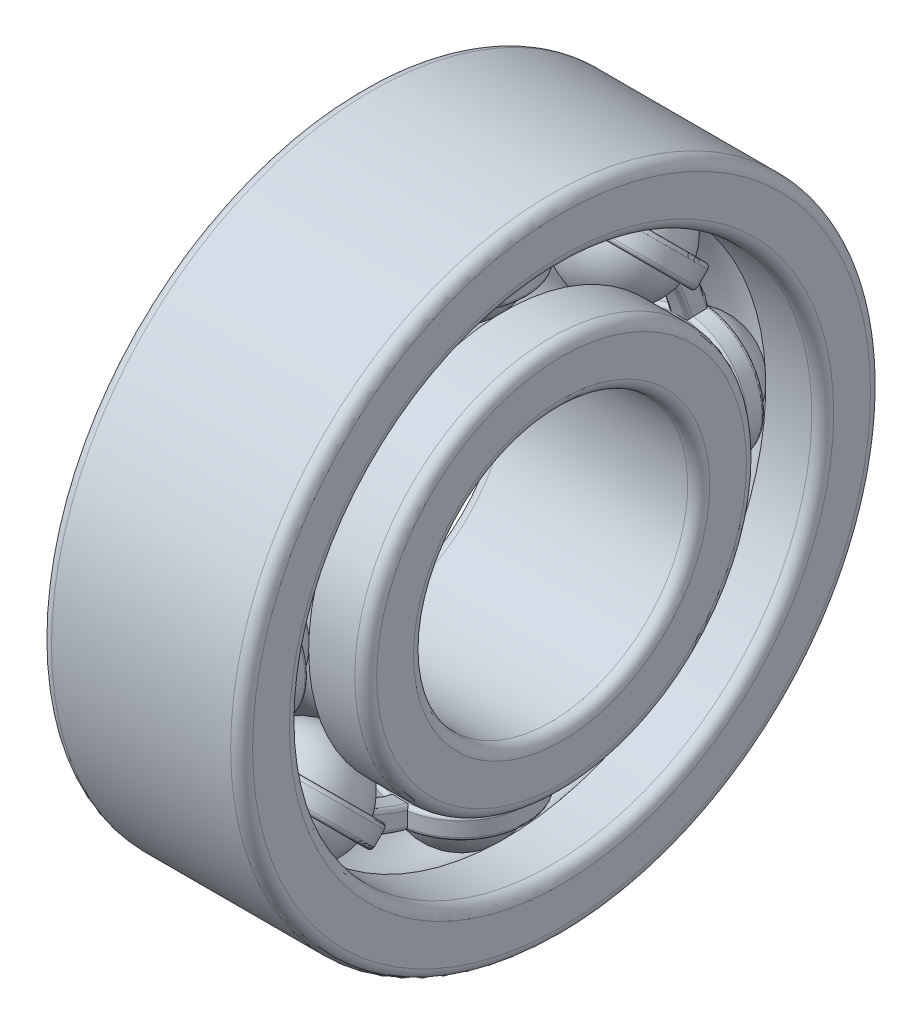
ISO-10303-21;
HEADER;
FILE_DESCRIPTION(('STEP AP214'),'2;1');
FILE_NAME('part.step','',(''),(''),'','','');
FILE_SCHEMA(('AUTOMOTIVE_DESIGN { 1 0 10303 214 1 1 1 1 }'));
ENDSEC;
DATA;
#1=APPLICATION_CONTEXT('core data for automotive mechanical design processes');
#2=APPLICATION_PROTOCOL_DEFINITION('international standard','automotive_design',2000,#1);
#3=PRODUCT_CONTEXT('',#1,'mechanical');
#4=PRODUCT('Part','Part','',(#3));
#5=PRODUCT_RELATED_PRODUCT_CATEGORY('part','',(#4));
#6=PRODUCT_DEFINITION_FORMATION('','',#4);
#7=PRODUCT_DEFINITION_CONTEXT('part definition',#1,'design');
#8=PRODUCT_DEFINITION('design','',#6,#7);
#9=PRODUCT_DEFINITION_SHAPE('','',#8);
#10=(LENGTH_UNIT() NAMED_UNIT(*) SI_UNIT(.MILLI.,.METRE.));
#11=(NAMED_UNIT(*) PLANE_ANGLE_UNIT() SI_UNIT($,.RADIAN.));
#12=(NAMED_UNIT(*) SI_UNIT($,.STERADIAN.) SOLID_ANGLE_UNIT());
#13=UNCERTAINTY_MEASURE_WITH_UNIT(LENGTH_MEASURE(1.E-05),#10,'distance_accuracy_value','');
#14=(GEOMETRIC_REPRESENTATION_CONTEXT(3) GLOBAL_UNCERTAINTY_ASSIGNED_CONTEXT((#13)) GLOBAL_UNIT_ASSIGNED_CONTEXT((#10,
#11,#12)) REPRESENTATION_CONTEXT('',''));
#15=CARTESIAN_POINT('',(0.,0.,0.));
#16=DIRECTION('',(0.,0.,1.));
#17=DIRECTION('',(1.,0.,0.));
#18=AXIS2_PLACEMENT_3D('',#15,#16,#17);
#19=CARTESIAN_POINT('',(0.,-8.55931545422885,8.55931545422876));
#20=DIRECTION('',(0.,0.707106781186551,-0.707106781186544));
#21=DIRECTION('',(0.,0.707106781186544,0.707106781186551));
#22=AXIS2_PLACEMENT_3D('',#19,#20,#21);
#23=TOROIDAL_SURFACE('',#22,3.3718,0.2);
#24=CARTESIAN_POINT('',(0.,-8.55931545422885,8.55931545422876));
#25=DIRECTION('',(0.,-0.707106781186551,0.707106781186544));
#26=DIRECTION('',(0.,-0.707106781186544,-0.707106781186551));
#27=AXIS2_PLACEMENT_3D('',#24,#25,#26);
#28=CIRCLE('',#27,3.5718);
#29=CARTESIAN_POINT('',(0.,-11.0849594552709,6.03367145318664));
#30=VERTEX_POINT('',#29);
#31=EDGE_CURVE('P0_E55',#30,#30,#28,.T.);
#32=ORIENTED_EDGE('',*,*,#31,.F.);
#33=EDGE_LOOP('',(#32));
#34=FACE_BOUND('',#33,.T.);
#35=CARTESIAN_POINT('',(0.,-8.41789409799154,8.41789409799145));
#36=DIRECTION('',(0.,-0.707106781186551,0.707106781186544));
#37=DIRECTION('',(0.,0.707106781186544,0.707106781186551));
#38=AXIS2_PLACEMENT_3D('',#35,#36,#37);
#39=CIRCLE('',#38,3.3718);
#40=CARTESIAN_POINT('',(0.,-10.8021167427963,6.03367145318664));
#41=VERTEX_POINT('',#40);
#42=CARTESIAN_POINT('',(0.,-6.03367145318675,10.8021167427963));
#43=VERTEX_POINT('',#42);
#44=EDGE_CURVE('P0_E47',#41,#43,#39,.F.);
#45=ORIENTED_EDGE('',*,*,#44,.F.);
#46=CARTESIAN_POINT('',(0.,-8.41789409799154,8.41789409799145));
#47=DIRECTION('',(0.,-0.707106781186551,0.707106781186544));
#48=DIRECTION('',(0.,-0.707106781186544,-0.707106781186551));
#49=AXIS2_PLACEMENT_3D('',#46,#47,#48);
#50=CIRCLE('',#49,3.3718);
#51=EDGE_CURVE('P0_E45',#43,#41,#50,.F.);
#52=ORIENTED_EDGE('',*,*,#51,.F.);
#53=EDGE_LOOP('',(#45,#52));
#54=FACE_BOUND('',#53,.T.);
#55=ADVANCED_FACE('P0_F17',(#34,#54),#23,.T.);
#56=CARTESIAN_POINT('',(0.,-10.9435380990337,10.9435380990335));
#57=DIRECTION('',(0.,-0.707106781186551,0.707106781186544));
#58=DIRECTION('',(0.,-0.707106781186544,-0.707106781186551));
#59=AXIS2_PLACEMENT_3D('',#56,#57,#58);
#60=CYLINDRICAL_SURFACE('',#59,3.5718);
#61=ORIENTED_EDGE('',*,*,#31,.T.);
#62=EDGE_LOOP('',(#61));
#63=FACE_BOUND('',#62,.T.);
#64=CARTESIAN_POINT('',(0.,-9.11835407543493,9.11835407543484));
#65=DIRECTION('',(0.,-0.707106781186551,0.707106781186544));
#66=DIRECTION('',(0.,-0.707106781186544,-0.707106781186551));
#67=AXIS2_PLACEMENT_3D('',#64,#65,#66);
#68=CIRCLE('',#67,3.5718);
#69=CARTESIAN_POINT('',(0.,-11.643998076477,6.59271007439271));
#70=VERTEX_POINT('',#69);
#71=EDGE_CURVE('P0_E51',#70,#70,#68,.T.);
#72=ORIENTED_EDGE('',*,*,#71,.F.);
#73=EDGE_LOOP('',(#72));
#74=FACE_BOUND('',#73,.T.);
#75=ADVANCED_FACE('P0_F73',(#63,#74),#60,.T.);
#76=CARTESIAN_POINT('',(-3.5718,-8.41789409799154,8.41789409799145));
#77=DIRECTION('',(0.,0.707106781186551,-0.707106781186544));
#78=DIRECTION('',(0.,0.707106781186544,0.707106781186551));
#79=AXIS2_PLACEMENT_3D('',#76,#77,#78);
#80=PLANE('',#79);
#81=CARTESIAN_POINT('',(0.,-8.41789409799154,8.41789409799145));
#82=DIRECTION('',(0.,-0.707106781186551,0.707106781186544));
#83=DIRECTION('',(0.,-0.707106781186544,-0.707106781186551));
#84=AXIS2_PLACEMENT_3D('',#81,#82,#83);
#85=CIRCLE('',#84,2.3812);
#86=CARTESIAN_POINT('',(0.,-10.1016567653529,6.73413143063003));
#87=VERTEX_POINT('',#86);
#88=EDGE_CURVE('P0_E88',#87,#87,#85,.T.);
#89=ORIENTED_EDGE('',*,*,#88,.T.);
#90=EDGE_LOOP('',(#89));
#91=FACE_BOUND('',#90,.T.);
#92=ORIENTED_EDGE('',*,*,#51,.T.);
#93=ORIENTED_EDGE('',*,*,#44,.T.);
#94=EDGE_LOOP('',(#92,#93));
#95=FACE_BOUND('',#94,.T.);
#96=ADVANCED_FACE('P0_F54',(#91,#95),#80,.T.);
#97=CARTESIAN_POINT('',(0.,-9.11835407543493,9.11835407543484));
#98=DIRECTION('',(0.,-0.707106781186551,0.707106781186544));
#99=DIRECTION('',(0.,-0.707106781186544,-0.707106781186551));
#100=AXIS2_PLACEMENT_3D('',#97,#98,#99);
#101=TOROIDAL_SURFACE('',#100,3.3718,0.2);
#102=ORIENTED_EDGE('',*,*,#71,.T.);
#103=EDGE_LOOP('',(#102));
#104=FACE_BOUND('',#103,.T.);
#105=CARTESIAN_POINT('',(0.,-9.25977543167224,9.25977543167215));
#106=DIRECTION('',(0.,0.707106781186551,-0.707106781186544));
#107=DIRECTION('',(0.,-0.707106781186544,-0.707106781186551));
#108=AXIS2_PLACEMENT_3D('',#105,#106,#107);
#109=CIRCLE('',#108,3.3718);
#110=CARTESIAN_POINT('',(0.,-6.87555278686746,11.643998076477));
#111=VERTEX_POINT('',#110);
#112=CARTESIAN_POINT('',(0.,-11.643998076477,6.87555278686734));
#113=VERTEX_POINT('',#112);
#114=EDGE_CURVE('P0_E29',#111,#113,#109,.F.);
#115=ORIENTED_EDGE('',*,*,#114,.F.);
#116=CARTESIAN_POINT('',(0.,-9.25977543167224,9.25977543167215));
#117=DIRECTION('',(0.,0.707106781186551,-0.707106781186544));
#118=DIRECTION('',(0.,0.707106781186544,0.707106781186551));
#119=AXIS2_PLACEMENT_3D('',#116,#117,#118);
#120=CIRCLE('',#119,3.3718);
#121=EDGE_CURVE('P0_E93',#113,#111,#120,.F.);
#122=ORIENTED_EDGE('',*,*,#121,.F.);
#123=EDGE_LOOP('',(#115,#122));
#124=FACE_BOUND('',#123,.T.);
#125=ADVANCED_FACE('P0_F72',(#104,#124),#101,.T.);
#126=CARTESIAN_POINT('',(0.,-10.9435380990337,10.9435380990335));
#127=DIRECTION('',(0.,-0.707106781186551,0.707106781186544));
#128=DIRECTION('',(0.,-0.707106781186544,-0.707106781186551));
#129=AXIS2_PLACEMENT_3D('',#126,#127,#128);
#130=CYLINDRICAL_SURFACE('',#129,2.3812);
#131=CARTESIAN_POINT('',(0.,-9.25977543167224,9.25977543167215));
#132=DIRECTION('',(0.,-0.707106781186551,0.707106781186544));
#133=DIRECTION('',(0.,-0.707106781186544,-0.707106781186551));
#134=AXIS2_PLACEMENT_3D('',#131,#132,#133);
#135=CIRCLE('',#134,2.3812);
#136=CARTESIAN_POINT('',(0.,-10.9435380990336,7.57601276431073));
#137=VERTEX_POINT('',#136);
#138=EDGE_CURVE('P0_E11',#137,#137,#135,.F.);
#139=ORIENTED_EDGE('',*,*,#138,.F.);
#140=EDGE_LOOP('',(#139));
#141=FACE_BOUND('',#140,.T.);
#142=ORIENTED_EDGE('',*,*,#88,.F.);
#143=EDGE_LOOP('',(#142));
#144=FACE_BOUND('',#143,.T.);
#145=ADVANCED_FACE('P0_F125',(#141,#144),#130,.F.);
#146=CARTESIAN_POINT('',(-3.5718,-9.25977543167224,9.25977543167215));
#147=DIRECTION('',(0.,-0.707106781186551,0.707106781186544));
#148=DIRECTION('',(0.,-0.707106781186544,-0.707106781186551));
#149=AXIS2_PLACEMENT_3D('',#146,#147,#148);
#150=PLANE('',#149);
#151=ORIENTED_EDGE('',*,*,#138,.T.);
#152=EDGE_LOOP('',(#151));
#153=FACE_BOUND('',#152,.T.);
#154=ORIENTED_EDGE('',*,*,#121,.T.);
#155=ORIENTED_EDGE('',*,*,#114,.T.);
#156=EDGE_LOOP('',(#154,#155));
#157=FACE_BOUND('',#156,.T.);
#158=ADVANCED_FACE('P0_F109',(#153,#157),#150,.T.);
#159=CLOSED_SHELL('',(#55,#75,#96,#125,#145,#158));
#160=MANIFOLD_SOLID_BREP('P0_B1',#159);
#161=CARTESIAN_POINT('',(0.,0.,0.));
#162=DIRECTION('',(-1.,0.,0.));
#163=DIRECTION('',(0.,0.,1.));
#164=AXIS2_PLACEMENT_3D('',#161,#162,#163);
#165=TOROIDAL_SURFACE('',#164,12.5,2.9765);
#166=CARTESIAN_POINT('',(-2.3812,0.,0.));
#167=DIRECTION('',(-1.,0.,0.));
#168=DIRECTION('',(0.,0.,1.));
#169=AXIS2_PLACEMENT_3D('',#166,#167,#168);
#170=CIRCLE('',#169,10.7141);
#171=CARTESIAN_POINT('',(-2.3812,0.,10.7141));
#172=VERTEX_POINT('',#171);
#173=EDGE_CURVE('P1_E130',#172,#172,#170,.T.);
#174=ORIENTED_EDGE('',*,*,#173,.F.);
#175=EDGE_LOOP('',(#174));
#176=FACE_BOUND('',#175,.T.);
#177=CARTESIAN_POINT('',(2.3812,0.,0.));
#178=DIRECTION('',(-1.,0.,0.));
#179=DIRECTION('',(0.,0.,1.));
#180=AXIS2_PLACEMENT_3D('',#177,#178,#179);
#181=CIRCLE('',#180,10.7141);
#182=CARTESIAN_POINT('',(2.3812,0.,10.7141));
#183=VERTEX_POINT('',#182);
#184=EDGE_CURVE('P1_E128',#183,#183,#181,.F.);
#185=ORIENTED_EDGE('',*,*,#184,.F.);
#186=EDGE_LOOP('',(#185));
#187=FACE_BOUND('',#186,.T.);
#188=ADVANCED_FACE('P1_F17',(#176,#187),#165,.F.);
#189=CARTESIAN_POINT('',(0.,0.,0.));
#190=DIRECTION('',(-1.,0.,0.));
#191=DIRECTION('',(0.,0.,1.));
#192=AXIS2_PLACEMENT_3D('',#189,#190,#191);
#193=CYLINDRICAL_SURFACE('',#192,10.7141);
#194=CARTESIAN_POINT('',(-4.9,0.,0.));
#195=DIRECTION('',(-1.,0.,0.));
#196=DIRECTION('',(0.,0.,1.));
#197=AXIS2_PLACEMENT_3D('',#194,#195,#196);
#198=CIRCLE('',#197,10.7141);
#199=CARTESIAN_POINT('',(-4.9,0.,10.7141));
#200=VERTEX_POINT('',#199);
#201=EDGE_CURVE('P1_E125',#200,#200,#198,.T.);
#202=ORIENTED_EDGE('',*,*,#201,.F.);
#203=EDGE_LOOP('',(#202));
#204=FACE_BOUND('',#203,.T.);
#205=ORIENTED_EDGE('',*,*,#173,.T.);
#206=EDGE_LOOP('',(#205));
#207=FACE_BOUND('',#206,.T.);
#208=ADVANCED_FACE('P1_F318',(#204,#207),#193,.T.);
#209=CARTESIAN_POINT('',(0.,0.,0.));
#210=DIRECTION('',(-1.,0.,0.));
#211=DIRECTION('',(0.,0.,1.));
#212=AXIS2_PLACEMENT_3D('',#209,#210,#211);
#213=CYLINDRICAL_SURFACE('',#212,10.7141);
#214=ORIENTED_EDGE('',*,*,#184,.T.);
#215=EDGE_LOOP('',(#214));
#216=FACE_BOUND('',#215,.T.);
#217=CARTESIAN_POINT('',(4.9,0.,0.));
#218=DIRECTION('',(-1.,0.,0.));
#219=DIRECTION('',(0.,0.,1.));
#220=AXIS2_PLACEMENT_3D('',#217,#218,#219);
#221=CIRCLE('',#220,10.7141);
#222=CARTESIAN_POINT('',(4.9,0.,10.7141));
#223=VERTEX_POINT('',#222);
#224=EDGE_CURVE('P1_E72',#223,#223,#221,.F.);
#225=ORIENTED_EDGE('',*,*,#224,.F.);
#226=EDGE_LOOP('',(#225));
#227=FACE_BOUND('',#226,.T.);
#228=ADVANCED_FACE('P1_F311',(#216,#227),#213,.T.);
#229=CARTESIAN_POINT('',(-4.9,0.,0.));
#230=DIRECTION('',(-1.,0.,0.));
#231=DIRECTION('',(0.,0.,1.));
#232=AXIS2_PLACEMENT_3D('',#229,#230,#231);
#233=TOROIDAL_SURFACE('',#232,10.1141,0.600000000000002);
#234=CARTESIAN_POINT('',(-5.5,0.,0.));
#235=DIRECTION('',(1.,0.,0.));
#236=DIRECTION('',(0.,0.,1.));
#237=AXIS2_PLACEMENT_3D('',#234,#235,#236);
#238=CIRCLE('',#237,10.1141);
#239=CARTESIAN_POINT('',(-5.5,0.,10.1141));
#240=VERTEX_POINT('',#239);
#241=CARTESIAN_POINT('',(-5.5,0.,-10.1141));
#242=VERTEX_POINT('',#241);
#243=EDGE_CURVE('P1_E58',#240,#242,#238,.T.);
#244=ORIENTED_EDGE('',*,*,#243,.T.);
#245=CARTESIAN_POINT('',(-5.5,0.,0.));
#246=DIRECTION('',(1.,0.,0.));
#247=DIRECTION('',(0.,0.,-1.));
#248=AXIS2_PLACEMENT_3D('',#245,#246,#247);
#249=CIRCLE('',#248,10.1141);
#250=EDGE_CURVE('P1_E61',#242,#240,#249,.T.);
#251=ORIENTED_EDGE('',*,*,#250,.T.);
#252=EDGE_LOOP('',(#244,#251));
#253=FACE_BOUND('',#252,.T.);
#254=ORIENTED_EDGE('',*,*,#201,.T.);
#255=EDGE_LOOP('',(#254));
#256=FACE_BOUND('',#255,.T.);
#257=ADVANCED_FACE('P1_F70',(#253,#256),#233,.T.);
#258=CARTESIAN_POINT('',(4.9,0.,0.));
#259=DIRECTION('',(-1.,0.,0.));
#260=DIRECTION('',(0.,0.,1.));
#261=AXIS2_PLACEMENT_3D('',#258,#259,#260);
#262=TOROIDAL_SURFACE('',#261,10.1141,0.600000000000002);
#263=ORIENTED_EDGE('',*,*,#224,.T.);
#264=EDGE_LOOP('',(#263));
#265=FACE_BOUND('',#264,.T.);
#266=CARTESIAN_POINT('',(5.5,0.,0.));
#267=DIRECTION('',(-1.,0.,0.));
#268=DIRECTION('',(0.,0.,1.));
#269=AXIS2_PLACEMENT_3D('',#266,#267,#268);
#270=CIRCLE('',#269,10.1141);
#271=CARTESIAN_POINT('',(5.5,0.,10.1141));
#272=VERTEX_POINT('',#271);
#273=CARTESIAN_POINT('',(5.5,0.,-10.1141));
#274=VERTEX_POINT('',#273);
#275=EDGE_CURVE('P1_E105',#272,#274,#270,.T.);
#276=ORIENTED_EDGE('',*,*,#275,.T.);
#277=CARTESIAN_POINT('',(5.5,0.,0.));
#278=DIRECTION('',(-1.,0.,0.));
#279=DIRECTION('',(0.,0.,-1.));
#280=AXIS2_PLACEMENT_3D('',#277,#278,#279);
#281=CIRCLE('',#280,10.1141);
#282=EDGE_CURVE('P1_E165',#274,#272,#281,.T.);
#283=ORIENTED_EDGE('',*,*,#282,.T.);
#284=EDGE_LOOP('',(#276,#283));
#285=FACE_BOUND('',#284,.T.);
#286=ADVANCED_FACE('P1_F80',(#265,#285),#262,.T.);
#287=CARTESIAN_POINT('',(-5.5,10.1141,0.));
#288=DIRECTION('',(1.,0.,0.));
#289=DIRECTION('',(0.,0.,-1.));
#290=AXIS2_PLACEMENT_3D('',#287,#288,#289);
#291=PLANE('',#290);
#292=ORIENTED_EDGE('',*,*,#243,.F.);
#293=ORIENTED_EDGE('',*,*,#250,.F.);
#294=EDGE_LOOP('',(#292,#293));
#295=FACE_BOUND('',#294,.T.);
#296=CARTESIAN_POINT('',(-5.5,0.,0.));
#297=DIRECTION('',(-1.,0.,0.));
#298=DIRECTION('',(0.,0.,-1.));
#299=AXIS2_PLACEMENT_3D('',#296,#297,#298);
#300=CIRCLE('',#299,8.1);
#301=CARTESIAN_POINT('',(-5.5,0.,-8.1));
#302=VERTEX_POINT('',#301);
#303=CARTESIAN_POINT('',(-5.5,0.,8.1));
#304=VERTEX_POINT('',#303);
#305=EDGE_CURVE('P1_E213',#302,#304,#300,.T.);
#306=ORIENTED_EDGE('',*,*,#305,.F.);
#307=CARTESIAN_POINT('',(-5.5,0.,0.));
#308=DIRECTION('',(-1.,0.,0.));
#309=DIRECTION('',(0.,0.,1.));
#310=AXIS2_PLACEMENT_3D('',#307,#308,#309);
#311=CIRCLE('',#310,8.1);
#312=EDGE_CURVE('P1_E67',#304,#302,#311,.T.);
#313=ORIENTED_EDGE('',*,*,#312,.F.);
#314=EDGE_LOOP('',(#306,#313));
#315=FACE_BOUND('',#314,.T.);
#316=ADVANCED_FACE('P1_F63',(#295,#315),#291,.F.);
#317=CARTESIAN_POINT('',(5.5,10.1141,0.));
#318=DIRECTION('',(-1.,0.,0.));
#319=DIRECTION('',(0.,0.,1.));
#320=AXIS2_PLACEMENT_3D('',#317,#318,#319);
#321=PLANE('',#320);
#322=CARTESIAN_POINT('',(5.5,0.,0.));
#323=DIRECTION('',(1.,0.,0.));
#324=DIRECTION('',(0.,0.,1.));
#325=AXIS2_PLACEMENT_3D('',#322,#323,#324);
#326=CIRCLE('',#325,8.1);
#327=CARTESIAN_POINT('',(5.5,0.,8.1));
#328=VERTEX_POINT('',#327);
#329=CARTESIAN_POINT('',(5.5,0.,-8.1));
#330=VERTEX_POINT('',#329);
#331=EDGE_CURVE('P1_E185',#328,#330,#326,.T.);
#332=ORIENTED_EDGE('',*,*,#331,.F.);
#333=CARTESIAN_POINT('',(5.5,0.,0.));
#334=DIRECTION('',(1.,0.,0.));
#335=DIRECTION('',(0.,0.,-1.));
#336=AXIS2_PLACEMENT_3D('',#333,#334,#335);
#337=CIRCLE('',#336,8.1);
#338=EDGE_CURVE('P1_E37',#330,#328,#337,.T.);
#339=ORIENTED_EDGE('',*,*,#338,.F.);
#340=EDGE_LOOP('',(#332,#339));
#341=FACE_BOUND('',#340,.T.);
#342=ORIENTED_EDGE('',*,*,#282,.F.);
#343=ORIENTED_EDGE('',*,*,#275,.F.);
#344=EDGE_LOOP('',(#342,#343));
#345=FACE_BOUND('',#344,.T.);
#346=ADVANCED_FACE('P1_F153',(#341,#345),#321,.F.);
#347=CARTESIAN_POINT('',(-4.9,0.,0.));
#348=DIRECTION('',(-1.,0.,0.));
#349=DIRECTION('',(0.,0.,1.));
#350=AXIS2_PLACEMENT_3D('',#347,#348,#349);
#351=TOROIDAL_SURFACE('',#350,8.1,0.600000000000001);
#352=ORIENTED_EDGE('',*,*,#312,.T.);
#353=ORIENTED_EDGE('',*,*,#305,.T.);
#354=EDGE_LOOP('',(#352,#353));
#355=FACE_BOUND('',#354,.T.);
#356=CARTESIAN_POINT('',(-4.9,0.,0.));
#357=DIRECTION('',(-1.,0.,0.));
#358=DIRECTION('',(0.,0.,1.));
#359=AXIS2_PLACEMENT_3D('',#356,#357,#358);
#360=CIRCLE('',#359,7.5);
#361=CARTESIAN_POINT('',(-4.9,0.,7.5));
#362=VERTEX_POINT('',#361);
#363=EDGE_CURVE('P1_E29',#362,#362,#360,.F.);
#364=ORIENTED_EDGE('',*,*,#363,.T.);
#365=EDGE_LOOP('',(#364));
#366=FACE_BOUND('',#365,.T.);
#367=ADVANCED_FACE('P1_F142',(#355,#366),#351,.T.);
#368=CARTESIAN_POINT('',(4.9,0.,0.));
#369=DIRECTION('',(-1.,0.,0.));
#370=DIRECTION('',(0.,0.,1.));
#371=AXIS2_PLACEMENT_3D('',#368,#369,#370);
#372=TOROIDAL_SURFACE('',#371,8.1,0.6);
#373=ORIENTED_EDGE('',*,*,#331,.T.);
#374=ORIENTED_EDGE('',*,*,#338,.T.);
#375=EDGE_LOOP('',(#373,#374));
#376=FACE_BOUND('',#375,.T.);
#377=CARTESIAN_POINT('',(4.9,0.,0.));
#378=DIRECTION('',(-1.,0.,0.));
#379=DIRECTION('',(0.,0.,1.));
#380=AXIS2_PLACEMENT_3D('',#377,#378,#379);
#381=CIRCLE('',#380,7.5);
#382=CARTESIAN_POINT('',(4.9,0.,7.5));
#383=VERTEX_POINT('',#382);
#384=EDGE_CURVE('P1_E11',#383,#383,#381,.T.);
#385=ORIENTED_EDGE('',*,*,#384,.T.);
#386=EDGE_LOOP('',(#385));
#387=FACE_BOUND('',#386,.T.);
#388=ADVANCED_FACE('P1_F152',(#376,#387),#372,.T.);
#389=CARTESIAN_POINT('',(0.,0.,0.));
#390=DIRECTION('',(-1.,0.,0.));
#391=DIRECTION('',(0.,0.,1.));
#392=AXIS2_PLACEMENT_3D('',#389,#390,#391);
#393=CYLINDRICAL_SURFACE('',#392,7.5);
#394=ORIENTED_EDGE('',*,*,#363,.F.);
#395=EDGE_LOOP('',(#394));
#396=FACE_BOUND('',#395,.T.);
#397=ORIENTED_EDGE('',*,*,#384,.F.);
#398=EDGE_LOOP('',(#397));
#399=FACE_BOUND('',#398,.T.);
#400=ADVANCED_FACE('P1_F256',(#396,#399),#393,.F.);
#401=CLOSED_SHELL('',(#188,#208,#228,#257,#286,#316,#346,#367,#388,#400));
#402=MANIFOLD_SOLID_BREP('P1_B1',#401);
#403=CARTESIAN_POINT('',(0.,12.8953,0.));
#404=DIRECTION('',(0.,1.,0.));
#405=DIRECTION('',(0.,0.,1.));
#406=AXIS2_PLACEMENT_3D('',#403,#404,#405);
#407=TOROIDAL_SURFACE('',#406,3.3718,0.2);
#408=CARTESIAN_POINT('',(0.,12.8953,0.));
#409=DIRECTION('',(0.,1.,0.));
#410=DIRECTION('',(0.,0.,1.));
#411=AXIS2_PLACEMENT_3D('',#408,#409,#410);
#412=CIRCLE('',#411,3.5718);
#413=CARTESIAN_POINT('',(0.,12.8953,3.5718));
#414=VERTEX_POINT('',#413);
#415=EDGE_CURVE('P2_E55',#414,#414,#412,.F.);
#416=ORIENTED_EDGE('',*,*,#415,.F.);
#417=EDGE_LOOP('',(#416));
#418=FACE_BOUND('',#417,.T.);
#419=CARTESIAN_POINT('',(0.,13.0953,0.));
#420=DIRECTION('',(0.,-1.,0.));
#421=DIRECTION('',(0.,0.,1.));
#422=AXIS2_PLACEMENT_3D('',#419,#420,#421);
#423=CIRCLE('',#422,3.3718);
#424=CARTESIAN_POINT('',(0.,13.0953,-3.3718));
#425=VERTEX_POINT('',#424);
#426=CARTESIAN_POINT('',(0.,13.0953,3.3718));
#427=VERTEX_POINT('',#426);
#428=EDGE_CURVE('P2_E47',#425,#427,#423,.F.);
#429=ORIENTED_EDGE('',*,*,#428,.F.);
#430=CARTESIAN_POINT('',(0.,13.0953,0.));
#431=DIRECTION('',(0.,-1.,0.));
#432=DIRECTION('',(0.,0.,-1.));
#433=AXIS2_PLACEMENT_3D('',#430,#431,#432);
#434=CIRCLE('',#433,3.3718);
#435=EDGE_CURVE('P2_E45',#427,#425,#434,.F.);
#436=ORIENTED_EDGE('',*,*,#435,.F.);
#437=EDGE_LOOP('',(#429,#436));
#438=FACE_BOUND('',#437,.T.);
#439=ADVANCED_FACE('P2_F17',(#418,#438),#407,.T.);
#440=CARTESIAN_POINT('',(0.,15.4765,0.));
#441=DIRECTION('',(0.,1.,0.));
#442=DIRECTION('',(0.,0.,1.));
#443=AXIS2_PLACEMENT_3D('',#440,#441,#442);
#444=CYLINDRICAL_SURFACE('',#443,3.5718);
#445=CARTESIAN_POINT('',(0.,12.1047,0.));
#446=DIRECTION('',(0.,-1.,0.));
#447=DIRECTION('',(0.,0.,-1.));
#448=AXIS2_PLACEMENT_3D('',#445,#446,#447);
#449=CIRCLE('',#448,3.5718);
#450=CARTESIAN_POINT('',(0.,12.1047,-3.5718));
#451=VERTEX_POINT('',#450);
#452=EDGE_CURVE('P2_E51',#451,#451,#449,.T.);
#453=ORIENTED_EDGE('',*,*,#452,.F.);
#454=EDGE_LOOP('',(#453));
#455=FACE_BOUND('',#454,.T.);
#456=ORIENTED_EDGE('',*,*,#415,.T.);
#457=EDGE_LOOP('',(#456));
#458=FACE_BOUND('',#457,.T.);
#459=ADVANCED_FACE('P2_F73',(#455,#458),#444,.T.);
#460=CARTESIAN_POINT('',(-3.5718,13.0953,0.));
#461=DIRECTION('',(0.,1.,0.));
#462=DIRECTION('',(0.,0.,1.));
#463=AXIS2_PLACEMENT_3D('',#460,#461,#462);
#464=PLANE('',#463);
#465=CARTESIAN_POINT('',(0.,13.0953,0.));
#466=DIRECTION('',(0.,1.,0.));
#467=DIRECTION('',(0.,0.,1.));
#468=AXIS2_PLACEMENT_3D('',#465,#466,#467);
#469=CIRCLE('',#468,2.3812);
#470=CARTESIAN_POINT('',(0.,13.0953,2.3812));
#471=VERTEX_POINT('',#470);
#472=EDGE_CURVE('P2_E88',#471,#471,#469,.F.);
#473=ORIENTED_EDGE('',*,*,#472,.T.);
#474=EDGE_LOOP('',(#473));
#475=FACE_BOUND('',#474,.T.);
#476=ORIENTED_EDGE('',*,*,#435,.T.);
#477=ORIENTED_EDGE('',*,*,#428,.T.);
#478=EDGE_LOOP('',(#476,#477));
#479=FACE_BOUND('',#478,.T.);
#480=ADVANCED_FACE('P2_F54',(#475,#479),#464,.T.);
#481=CARTESIAN_POINT('',(0.,12.1047,0.));
#482=DIRECTION('',(0.,-1.,0.));
#483=DIRECTION('',(0.,0.,-1.));
#484=AXIS2_PLACEMENT_3D('',#481,#482,#483);
#485=TOROIDAL_SURFACE('',#484,3.3718,0.2);
#486=ORIENTED_EDGE('',*,*,#452,.T.);
#487=EDGE_LOOP('',(#486));
#488=FACE_BOUND('',#487,.T.);
#489=CARTESIAN_POINT('',(0.,11.9047,0.));
#490=DIRECTION('',(0.,1.,0.));
#491=DIRECTION('',(0.,0.,-1.));
#492=AXIS2_PLACEMENT_3D('',#489,#490,#491);
#493=CIRCLE('',#492,3.3718);
#494=CARTESIAN_POINT('',(0.,11.9047,3.3718));
#495=VERTEX_POINT('',#494);
#496=CARTESIAN_POINT('',(0.,11.9047,-3.3718));
#497=VERTEX_POINT('',#496);
#498=EDGE_CURVE('P2_E29',#495,#497,#493,.F.);
#499=ORIENTED_EDGE('',*,*,#498,.F.);
#500=CARTESIAN_POINT('',(0.,11.9047,0.));
#501=DIRECTION('',(0.,1.,0.));
#502=DIRECTION('',(0.,0.,1.));
#503=AXIS2_PLACEMENT_3D('',#500,#501,#502);
#504=CIRCLE('',#503,3.3718);
#505=EDGE_CURVE('P2_E93',#497,#495,#504,.F.);
#506=ORIENTED_EDGE('',*,*,#505,.F.);
#507=EDGE_LOOP('',(#499,#506));
#508=FACE_BOUND('',#507,.T.);
#509=ADVANCED_FACE('P2_F72',(#488,#508),#485,.T.);
#510=CARTESIAN_POINT('',(0.,15.4765,0.));
#511=DIRECTION('',(0.,1.,0.));
#512=DIRECTION('',(0.,0.,1.));
#513=AXIS2_PLACEMENT_3D('',#510,#511,#512);
#514=CYLINDRICAL_SURFACE('',#513,2.3812);
#515=ORIENTED_EDGE('',*,*,#472,.F.);
#516=EDGE_LOOP('',(#515));
#517=FACE_BOUND('',#516,.T.);
#518=CARTESIAN_POINT('',(0.,11.9047,0.));
#519=DIRECTION('',(0.,1.,0.));
#520=DIRECTION('',(0.,0.,1.));
#521=AXIS2_PLACEMENT_3D('',#518,#519,#520);
#522=CIRCLE('',#521,2.3812);
#523=CARTESIAN_POINT('',(0.,11.9047,2.3812));
#524=VERTEX_POINT('',#523);
#525=EDGE_CURVE('P2_E11',#524,#524,#522,.T.);
#526=ORIENTED_EDGE('',*,*,#525,.F.);
#527=EDGE_LOOP('',(#526));
#528=FACE_BOUND('',#527,.T.);
#529=ADVANCED_FACE('P2_F125',(#517,#528),#514,.F.);
#530=CARTESIAN_POINT('',(-3.5718,11.9047,0.));
#531=DIRECTION('',(0.,-1.,0.));
#532=DIRECTION('',(0.,0.,-1.));
#533=AXIS2_PLACEMENT_3D('',#530,#531,#532);
#534=PLANE('',#533);
#535=ORIENTED_EDGE('',*,*,#525,.T.);
#536=EDGE_LOOP('',(#535));
#537=FACE_BOUND('',#536,.T.);
#538=ORIENTED_EDGE('',*,*,#505,.T.);
#539=ORIENTED_EDGE('',*,*,#498,.T.);
#540=EDGE_LOOP('',(#538,#539));
#541=FACE_BOUND('',#540,.T.);
#542=ADVANCED_FACE('P2_F109',(#537,#541),#534,.T.);
#543=CLOSED_SHELL('',(#439,#459,#480,#509,#529,#542));
#544=MANIFOLD_SOLID_BREP('P2_B1',#543);
#545=CARTESIAN_POINT('',(0.,1.35071097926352E-13,-12.8953));
#546=DIRECTION('',(0.,0.,-1.));
#547=DIRECTION('',(0.,1.,0.));
#548=AXIS2_PLACEMENT_3D('',#545,#546,#547);
#549=TOROIDAL_SURFACE('',#548,3.3718,0.2);
#550=CARTESIAN_POINT('',(0.,1.35071097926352E-13,-12.8953));
#551=DIRECTION('',(0.,0.,-1.));
#552=DIRECTION('',(0.,1.,0.));
#553=AXIS2_PLACEMENT_3D('',#550,#551,#552);
#554=CIRCLE('',#553,3.5718);
#555=CARTESIAN_POINT('',(0.,3.57180000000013,-12.8953));
#556=VERTEX_POINT('',#555);
#557=EDGE_CURVE('P3_E55',#556,#556,#554,.F.);
#558=ORIENTED_EDGE('',*,*,#557,.F.);
#559=EDGE_LOOP('',(#558));
#560=FACE_BOUND('',#559,.T.);
#561=CARTESIAN_POINT('',(0.,1.37165986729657E-13,-13.0953));
#562=DIRECTION('',(0.,0.,1.));
#563=DIRECTION('',(0.,1.,0.));
#564=AXIS2_PLACEMENT_3D('',#561,#562,#563);
#565=CIRCLE('',#564,3.3718);
#566=CARTESIAN_POINT('',(0.,-3.37179999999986,-13.0953));
#567=VERTEX_POINT('',#566);
#568=CARTESIAN_POINT('',(0.,3.37180000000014,-13.0953));
#569=VERTEX_POINT('',#568);
#570=EDGE_CURVE('P3_E47',#567,#569,#565,.F.);
#571=ORIENTED_EDGE('',*,*,#570,.F.);
#572=CARTESIAN_POINT('',(0.,1.37165986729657E-13,-13.0953));
#573=DIRECTION('',(0.,0.,1.));
#574=DIRECTION('',(0.,-1.,0.));
#575=AXIS2_PLACEMENT_3D('',#572,#573,#574);
#576=CIRCLE('',#575,3.3718);
#577=EDGE_CURVE('P3_E45',#569,#567,#576,.F.);
#578=ORIENTED_EDGE('',*,*,#577,.F.);
#579=EDGE_LOOP('',(#571,#578));
#580=FACE_BOUND('',#579,.T.);
#581=ADVANCED_FACE('P3_F17',(#560,#580),#549,.T.);
#582=CARTESIAN_POINT('',(0.,1.62107732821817E-13,-15.4765));
#583=DIRECTION('',(0.,0.,-1.));
#584=DIRECTION('',(0.,1.,0.));
#585=AXIS2_PLACEMENT_3D('',#582,#583,#584);
#586=CYLINDRICAL_SURFACE('',#585,3.5718);
#587=CARTESIAN_POINT('',(0.,1.26790002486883E-13,-12.1047));
#588=DIRECTION('',(0.,0.,1.));
#589=DIRECTION('',(0.,-1.,0.));
#590=AXIS2_PLACEMENT_3D('',#587,#588,#589);
#591=CIRCLE('',#590,3.5718);
#592=CARTESIAN_POINT('',(0.,-3.57179999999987,-12.1047));
#593=VERTEX_POINT('',#592);
#594=EDGE_CURVE('P3_E51',#593,#593,#591,.T.);
#595=ORIENTED_EDGE('',*,*,#594,.F.);
#596=EDGE_LOOP('',(#595));
#597=FACE_BOUND('',#596,.T.);
#598=ORIENTED_EDGE('',*,*,#557,.T.);
#599=EDGE_LOOP('',(#598));
#600=FACE_BOUND('',#599,.T.);
#601=ADVANCED_FACE('P3_F73',(#597,#600),#586,.T.);
#602=CARTESIAN_POINT('',(-3.5718,1.37165986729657E-13,-13.0953));
#603=DIRECTION('',(0.,0.,-1.));
#604=DIRECTION('',(0.,1.,0.));
#605=AXIS2_PLACEMENT_3D('',#602,#603,#604);
#606=PLANE('',#605);
#607=CARTESIAN_POINT('',(0.,1.37165986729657E-13,-13.0953));
#608=DIRECTION('',(0.,0.,-1.));
#609=DIRECTION('',(0.,1.,0.));
#610=AXIS2_PLACEMENT_3D('',#607,#608,#609);
#611=CIRCLE('',#610,2.3812);
#612=CARTESIAN_POINT('',(0.,2.38120000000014,-13.0953));
#613=VERTEX_POINT('',#612);
#614=EDGE_CURVE('P3_E88',#613,#613,#611,.F.);
#615=ORIENTED_EDGE('',*,*,#614,.T.);
#616=EDGE_LOOP('',(#615));
#617=FACE_BOUND('',#616,.T.);
#618=ORIENTED_EDGE('',*,*,#577,.T.);
#619=ORIENTED_EDGE('',*,*,#570,.T.);
#620=EDGE_LOOP('',(#618,#619));
#621=FACE_BOUND('',#620,.T.);
#622=ADVANCED_FACE('P3_F54',(#617,#621),#606,.T.);
#623=CARTESIAN_POINT('',(0.,1.26790002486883E-13,-12.1047));
#624=DIRECTION('',(0.,0.,1.));
#625=DIRECTION('',(0.,-1.,0.));
#626=AXIS2_PLACEMENT_3D('',#623,#624,#625);
#627=TOROIDAL_SURFACE('',#626,3.3718,0.2);
#628=ORIENTED_EDGE('',*,*,#594,.T.);
#629=EDGE_LOOP('',(#628));
#630=FACE_BOUND('',#629,.T.);
#631=CARTESIAN_POINT('',(0.,1.24695113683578E-13,-11.9047));
#632=DIRECTION('',(0.,0.,-1.));
#633=DIRECTION('',(0.,-1.,0.));
#634=AXIS2_PLACEMENT_3D('',#631,#632,#633);
#635=CIRCLE('',#634,3.3718);
#636=CARTESIAN_POINT('',(0.,3.37180000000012,-11.9047));
#637=VERTEX_POINT('',#636);
#638=CARTESIAN_POINT('',(0.,-3.37179999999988,-11.9047));
#639=VERTEX_POINT('',#638);
#640=EDGE_CURVE('P3_E29',#637,#639,#635,.F.);
#641=ORIENTED_EDGE('',*,*,#640,.F.);
#642=CARTESIAN_POINT('',(0.,1.24695113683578E-13,-11.9047));
#643=DIRECTION('',(0.,0.,-1.));
#644=DIRECTION('',(0.,1.,0.));
#645=AXIS2_PLACEMENT_3D('',#642,#643,#644);
#646=CIRCLE('',#645,3.3718);
#647=EDGE_CURVE('P3_E93',#639,#637,#646,.F.);
#648=ORIENTED_EDGE('',*,*,#647,.F.);
#649=EDGE_LOOP('',(#641,#648));
#650=FACE_BOUND('',#649,.T.);
#651=ADVANCED_FACE('P3_F72',(#630,#650),#627,.T.);
#652=CARTESIAN_POINT('',(0.,1.62107732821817E-13,-15.4765));
#653=DIRECTION('',(0.,0.,-1.));
#654=DIRECTION('',(0.,1.,0.));
#655=AXIS2_PLACEMENT_3D('',#652,#653,#654);
#656=CYLINDRICAL_SURFACE('',#655,2.3812);
#657=ORIENTED_EDGE('',*,*,#614,.F.);
#658=EDGE_LOOP('',(#657));
#659=FACE_BOUND('',#658,.T.);
#660=CARTESIAN_POINT('',(0.,1.24695113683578E-13,-11.9047));
#661=DIRECTION('',(0.,0.,-1.));
#662=DIRECTION('',(0.,1.,0.));
#663=AXIS2_PLACEMENT_3D('',#660,#661,#662);
#664=CIRCLE('',#663,2.3812);
#665=CARTESIAN_POINT('',(0.,2.38120000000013,-11.9047));
#666=VERTEX_POINT('',#665);
#667=EDGE_CURVE('P3_E11',#666,#666,#664,.T.);
#668=ORIENTED_EDGE('',*,*,#667,.F.);
#669=EDGE_LOOP('',(#668));
#670=FACE_BOUND('',#669,.T.);
#671=ADVANCED_FACE('P3_F125',(#659,#670),#656,.F.);
#672=CARTESIAN_POINT('',(-3.5718,1.24695113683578E-13,-11.9047));
#673=DIRECTION('',(0.,0.,1.));
#674=DIRECTION('',(0.,-1.,0.));
#675=AXIS2_PLACEMENT_3D('',#672,#673,#674);
#676=PLANE('',#675);
#677=ORIENTED_EDGE('',*,*,#667,.T.);
#678=EDGE_LOOP('',(#677));
#679=FACE_BOUND('',#678,.T.);
#680=ORIENTED_EDGE('',*,*,#647,.T.);
#681=ORIENTED_EDGE('',*,*,#640,.T.);
#682=EDGE_LOOP('',(#680,#681));
#683=FACE_BOUND('',#682,.T.);
#684=ADVANCED_FACE('P3_F109',(#679,#683),#676,.T.);
#685=CLOSED_SHELL('',(#581,#601,#622,#651,#671,#684));
#686=MANIFOLD_SOLID_BREP('P3_B1',#685);
#687=CARTESIAN_POINT('',(0.,0.,12.8953));
#688=DIRECTION('',(0.,0.,1.));
#689=DIRECTION('',(0.,-1.,0.));
#690=AXIS2_PLACEMENT_3D('',#687,#688,#689);
#691=TOROIDAL_SURFACE('',#690,3.3718,0.2);
#692=CARTESIAN_POINT('',(0.,0.,12.8953));
#693=DIRECTION('',(0.,0.,1.));
#694=DIRECTION('',(0.,-1.,0.));
#695=AXIS2_PLACEMENT_3D('',#692,#693,#694);
#696=CIRCLE('',#695,3.5718);
#697=CARTESIAN_POINT('',(0.,-3.57180000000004,12.8953));
#698=VERTEX_POINT('',#697);
#699=EDGE_CURVE('P4_E55',#698,#698,#696,.F.);
#700=ORIENTED_EDGE('',*,*,#699,.F.);
#701=EDGE_LOOP('',(#700));
#702=FACE_BOUND('',#701,.T.);
#703=CARTESIAN_POINT('',(0.,0.,13.0953));
#704=DIRECTION('',(0.,0.,-1.));
#705=DIRECTION('',(0.,-1.,0.));
#706=AXIS2_PLACEMENT_3D('',#703,#704,#705);
#707=CIRCLE('',#706,3.3718);
#708=CARTESIAN_POINT('',(0.,3.37179999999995,13.0953));
#709=VERTEX_POINT('',#708);
#710=CARTESIAN_POINT('',(0.,-3.37180000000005,13.0953));
#711=VERTEX_POINT('',#710);
#712=EDGE_CURVE('P4_E47',#709,#711,#707,.F.);
#713=ORIENTED_EDGE('',*,*,#712,.F.);
#714=CARTESIAN_POINT('',(0.,0.,13.0953));
#715=DIRECTION('',(0.,0.,-1.));
#716=DIRECTION('',(0.,1.,0.));
#717=AXIS2_PLACEMENT_3D('',#714,#715,#716);
#718=CIRCLE('',#717,3.3718);
#719=EDGE_CURVE('P4_E45',#711,#709,#718,.F.);
#720=ORIENTED_EDGE('',*,*,#719,.F.);
#721=EDGE_LOOP('',(#713,#720));
#722=FACE_BOUND('',#721,.T.);
#723=ADVANCED_FACE('P4_F17',(#702,#722),#691,.T.);
#724=CARTESIAN_POINT('',(0.,0.,15.4765));
#725=DIRECTION('',(0.,0.,1.));
#726=DIRECTION('',(0.,-1.,0.));
#727=AXIS2_PLACEMENT_3D('',#724,#725,#726);
#728=CYLINDRICAL_SURFACE('',#727,3.5718);
#729=CARTESIAN_POINT('',(0.,0.,12.1047));
#730=DIRECTION('',(0.,0.,-1.));
#731=DIRECTION('',(0.,1.,0.));
#732=AXIS2_PLACEMENT_3D('',#729,#730,#731);
#733=CIRCLE('',#732,3.5718);
#734=CARTESIAN_POINT('',(0.,3.57179999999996,12.1047));
#735=VERTEX_POINT('',#734);
#736=EDGE_CURVE('P4_E51',#735,#735,#733,.T.);
#737=ORIENTED_EDGE('',*,*,#736,.F.);
#738=EDGE_LOOP('',(#737));
#739=FACE_BOUND('',#738,.T.);
#740=ORIENTED_EDGE('',*,*,#699,.T.);
#741=EDGE_LOOP('',(#740));
#742=FACE_BOUND('',#741,.T.);
#743=ADVANCED_FACE('P4_F73',(#739,#742),#728,.T.);
#744=CARTESIAN_POINT('',(-3.5718,0.,13.0953));
#745=DIRECTION('',(0.,0.,1.));
#746=DIRECTION('',(0.,-1.,0.));
#747=AXIS2_PLACEMENT_3D('',#744,#745,#746);
#748=PLANE('',#747);
#749=CARTESIAN_POINT('',(0.,0.,13.0953));
#750=DIRECTION('',(0.,0.,1.));
#751=DIRECTION('',(0.,-1.,0.));
#752=AXIS2_PLACEMENT_3D('',#749,#750,#751);
#753=CIRCLE('',#752,2.3812);
#754=CARTESIAN_POINT('',(0.,-2.38120000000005,13.0953));
#755=VERTEX_POINT('',#754);
#756=EDGE_CURVE('P4_E88',#755,#755,#753,.F.);
#757=ORIENTED_EDGE('',*,*,#756,.T.);
#758=EDGE_LOOP('',(#757));
#759=FACE_BOUND('',#758,.T.);
#760=ORIENTED_EDGE('',*,*,#719,.T.);
#761=ORIENTED_EDGE('',*,*,#712,.T.);
#762=EDGE_LOOP('',(#760,#761));
#763=FACE_BOUND('',#762,.T.);
#764=ADVANCED_FACE('P4_F54',(#759,#763),#748,.T.);
#765=CARTESIAN_POINT('',(0.,0.,12.1047));
#766=DIRECTION('',(0.,0.,-1.));
#767=DIRECTION('',(0.,1.,0.));
#768=AXIS2_PLACEMENT_3D('',#765,#766,#767);
#769=TOROIDAL_SURFACE('',#768,3.3718,0.2);
#770=ORIENTED_EDGE('',*,*,#736,.T.);
#771=EDGE_LOOP('',(#770));
#772=FACE_BOUND('',#771,.T.);
#773=CARTESIAN_POINT('',(0.,0.,11.9047));
#774=DIRECTION('',(0.,0.,1.));
#775=DIRECTION('',(0.,1.,0.));
#776=AXIS2_PLACEMENT_3D('',#773,#774,#775);
#777=CIRCLE('',#776,3.3718);
#778=CARTESIAN_POINT('',(0.,-3.37180000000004,11.9047));
#779=VERTEX_POINT('',#778);
#780=CARTESIAN_POINT('',(0.,3.37179999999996,11.9047));
#781=VERTEX_POINT('',#780);
#782=EDGE_CURVE('P4_E29',#779,#781,#777,.F.);
#783=ORIENTED_EDGE('',*,*,#782,.F.);
#784=CARTESIAN_POINT('',(0.,0.,11.9047));
#785=DIRECTION('',(0.,0.,1.));
#786=DIRECTION('',(0.,-1.,0.));
#787=AXIS2_PLACEMENT_3D('',#784,#785,#786);
#788=CIRCLE('',#787,3.3718);
#789=EDGE_CURVE('P4_E93',#781,#779,#788,.F.);
#790=ORIENTED_EDGE('',*,*,#789,.F.);
#791=EDGE_LOOP('',(#783,#790));
#792=FACE_BOUND('',#791,.T.);
#793=ADVANCED_FACE('P4_F72',(#772,#792),#769,.T.);
#794=CARTESIAN_POINT('',(0.,0.,15.4765));
#795=DIRECTION('',(0.,0.,1.));
#796=DIRECTION('',(0.,-1.,0.));
#797=AXIS2_PLACEMENT_3D('',#794,#795,#796);
#798=CYLINDRICAL_SURFACE('',#797,2.3812);
#799=ORIENTED_EDGE('',*,*,#756,.F.);
#800=EDGE_LOOP('',(#799));
#801=FACE_BOUND('',#800,.T.);
#802=CARTESIAN_POINT('',(0.,0.,11.9047));
#803=DIRECTION('',(0.,0.,1.));
#804=DIRECTION('',(0.,-1.,0.));
#805=AXIS2_PLACEMENT_3D('',#802,#803,#804);
#806=CIRCLE('',#805,2.3812);
#807=CARTESIAN_POINT('',(0.,-2.38120000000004,11.9047));
#808=VERTEX_POINT('',#807);
#809=EDGE_CURVE('P4_E11',#808,#808,#806,.T.);
#810=ORIENTED_EDGE('',*,*,#809,.F.);
#811=EDGE_LOOP('',(#810));
#812=FACE_BOUND('',#811,.T.);
#813=ADVANCED_FACE('P4_F125',(#801,#812),#798,.F.);
#814=CARTESIAN_POINT('',(-3.5718,0.,11.9047));
#815=DIRECTION('',(0.,0.,-1.));
#816=DIRECTION('',(0.,1.,0.));
#817=AXIS2_PLACEMENT_3D('',#814,#815,#816);
#818=PLANE('',#817);
#819=ORIENTED_EDGE('',*,*,#809,.T.);
#820=EDGE_LOOP('',(#819));
#821=FACE_BOUND('',#820,.T.);
#822=ORIENTED_EDGE('',*,*,#789,.T.);
#823=ORIENTED_EDGE('',*,*,#782,.T.);
#824=EDGE_LOOP('',(#822,#823));
#825=FACE_BOUND('',#824,.T.);
#826=ADVANCED_FACE('P4_F109',(#821,#825),#818,.T.);
#827=CLOSED_SHELL('',(#723,#743,#764,#793,#813,#826));
#828=MANIFOLD_SOLID_BREP('P4_B1',#827);
#829=CARTESIAN_POINT('',(0.,12.5,0.));
#830=DIRECTION('',(1.,0.,0.));
#831=DIRECTION('',(0.,-1.,0.));
#832=AXIS2_PLACEMENT_3D('',#829,#830,#831);
#833=SPHERICAL_SURFACE('',#832,2.9765);
#834=CARTESIAN_POINT('',(-2.9765,12.5,0.));
#835=VERTEX_POINT('',#834);
#836=VERTEX_LOOP('',#835);
#837=FACE_BOUND('',#836,.T.);
#838=CARTESIAN_POINT('',(2.9765,12.5,0.));
#839=VERTEX_POINT('',#838);
#840=VERTEX_LOOP('',#839);
#841=FACE_BOUND('',#840,.T.);
#842=ADVANCED_FACE('P5_F16',(#837,#841),#833,.T.);
#843=CLOSED_SHELL('',(#842));
#844=MANIFOLD_SOLID_BREP('P5_B1',#843);
#845=CARTESIAN_POINT('',(0.,0.,0.));
#846=DIRECTION('',(-1.,0.,0.));
#847=DIRECTION('',(0.,0.,1.));
#848=AXIS2_PLACEMENT_3D('',#845,#846,#847);
#849=TOROIDAL_SURFACE('',#848,12.5,2.9765);
#850=CARTESIAN_POINT('',(2.3812,0.,0.));
#851=DIRECTION('',(-1.,0.,0.));
#852=DIRECTION('',(0.,0.,1.));
#853=AXIS2_PLACEMENT_3D('',#850,#851,#852);
#854=CIRCLE('',#853,14.2859);
#855=CARTESIAN_POINT('',(2.3812,0.,14.2859));
#856=VERTEX_POINT('',#855);
#857=EDGE_CURVE('P6_E288',#856,#856,#854,.F.);
#858=ORIENTED_EDGE('',*,*,#857,.T.);
#859=EDGE_LOOP('',(#858));
#860=FACE_BOUND('',#859,.T.);
#861=CARTESIAN_POINT('',(-2.3812,0.,0.));
#862=DIRECTION('',(-1.,0.,0.));
#863=DIRECTION('',(0.,0.,1.));
#864=AXIS2_PLACEMENT_3D('',#861,#862,#863);
#865=CIRCLE('',#864,14.2859);
#866=CARTESIAN_POINT('',(-2.3812,0.,14.2859));
#867=VERTEX_POINT('',#866);
#868=EDGE_CURVE('P6_E291',#867,#867,#865,.T.);
#869=ORIENTED_EDGE('',*,*,#868,.T.);
#870=EDGE_LOOP('',(#869));
#871=FACE_BOUND('',#870,.T.);
#872=ADVANCED_FACE('P6_F17',(#860,#871),#849,.F.);
#873=CARTESIAN_POINT('',(0.,0.,0.));
#874=DIRECTION('',(-1.,0.,0.));
#875=DIRECTION('',(0.,0.,1.));
#876=AXIS2_PLACEMENT_3D('',#873,#874,#875);
#877=CYLINDRICAL_SURFACE('',#876,14.2859);
#878=CARTESIAN_POINT('',(4.9,0.,0.));
#879=DIRECTION('',(-1.,0.,0.));
#880=DIRECTION('',(0.,0.,1.));
#881=AXIS2_PLACEMENT_3D('',#878,#879,#880);
#882=CIRCLE('',#881,14.2859);
#883=CARTESIAN_POINT('',(4.9,0.,14.2859));
#884=VERTEX_POINT('',#883);
#885=EDGE_CURVE('P6_E292',#884,#884,#882,.T.);
#886=ORIENTED_EDGE('',*,*,#885,.F.);
#887=EDGE_LOOP('',(#886));
#888=FACE_BOUND('',#887,.T.);
#889=ORIENTED_EDGE('',*,*,#857,.F.);
#890=EDGE_LOOP('',(#889));
#891=FACE_BOUND('',#890,.T.);
#892=ADVANCED_FACE('P6_F242',(#888,#891),#877,.F.);
#893=CARTESIAN_POINT('',(0.,0.,0.));
#894=DIRECTION('',(-1.,0.,0.));
#895=DIRECTION('',(0.,0.,1.));
#896=AXIS2_PLACEMENT_3D('',#893,#894,#895);
#897=CYLINDRICAL_SURFACE('',#896,14.2859);
#898=ORIENTED_EDGE('',*,*,#868,.F.);
#899=EDGE_LOOP('',(#898));
#900=FACE_BOUND('',#899,.T.);
#901=CARTESIAN_POINT('',(-4.9,0.,0.));
#902=DIRECTION('',(-1.,0.,0.));
#903=DIRECTION('',(0.,0.,1.));
#904=AXIS2_PLACEMENT_3D('',#901,#902,#903);
#905=CIRCLE('',#904,14.2859);
#906=CARTESIAN_POINT('',(-4.9,0.,14.2859));
#907=VERTEX_POINT('',#906);
#908=EDGE_CURVE('P6_E66',#907,#907,#905,.F.);
#909=ORIENTED_EDGE('',*,*,#908,.F.);
#910=EDGE_LOOP('',(#909));
#911=FACE_BOUND('',#910,.T.);
#912=ADVANCED_FACE('P6_F236',(#900,#911),#897,.F.);
#913=CARTESIAN_POINT('',(4.9,0.,0.));
#914=DIRECTION('',(-1.,0.,0.));
#915=DIRECTION('',(0.,0.,1.));
#916=AXIS2_PLACEMENT_3D('',#913,#914,#915);
#917=TOROIDAL_SURFACE('',#916,14.8859,0.600000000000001);
#918=CARTESIAN_POINT('',(5.5,0.,0.));
#919=DIRECTION('',(1.,0.,0.));
#920=DIRECTION('',(0.,0.,1.));
#921=AXIS2_PLACEMENT_3D('',#918,#919,#920);
#922=CIRCLE('',#921,14.8859);
#923=CARTESIAN_POINT('',(5.5,0.,14.8859));
#924=VERTEX_POINT('',#923);
#925=CARTESIAN_POINT('',(5.5,0.,-14.8859));
#926=VERTEX_POINT('',#925);
#927=EDGE_CURVE('P6_E61',#924,#926,#922,.T.);
#928=ORIENTED_EDGE('',*,*,#927,.T.);
#929=CARTESIAN_POINT('',(5.5,0.,0.));
#930=DIRECTION('',(1.,0.,0.));
#931=DIRECTION('',(0.,0.,-1.));
#932=AXIS2_PLACEMENT_3D('',#929,#930,#931);
#933=CIRCLE('',#932,14.8859);
#934=EDGE_CURVE('P6_E58',#926,#924,#933,.T.);
#935=ORIENTED_EDGE('',*,*,#934,.T.);
#936=EDGE_LOOP('',(#928,#935));
#937=FACE_BOUND('',#936,.T.);
#938=ORIENTED_EDGE('',*,*,#885,.T.);
#939=EDGE_LOOP('',(#938));
#940=FACE_BOUND('',#939,.T.);
#941=ADVANCED_FACE('P6_F62',(#937,#940),#917,.T.);
#942=CARTESIAN_POINT('',(-4.9,0.,0.));
#943=DIRECTION('',(-1.,0.,0.));
#944=DIRECTION('',(0.,0.,1.));
#945=AXIS2_PLACEMENT_3D('',#942,#943,#944);
#946=TOROIDAL_SURFACE('',#945,14.8859,0.600000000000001);
#947=ORIENTED_EDGE('',*,*,#908,.T.);
#948=EDGE_LOOP('',(#947));
#949=FACE_BOUND('',#948,.T.);
#950=CARTESIAN_POINT('',(-5.5,0.,0.));
#951=DIRECTION('',(-1.,0.,0.));
#952=DIRECTION('',(0.,0.,1.));
#953=AXIS2_PLACEMENT_3D('',#950,#951,#952);
#954=CIRCLE('',#953,14.8859);
#955=CARTESIAN_POINT('',(-5.5,0.,14.8859));
#956=VERTEX_POINT('',#955);
#957=CARTESIAN_POINT('',(-5.5,0.,-14.8859));
#958=VERTEX_POINT('',#957);
#959=EDGE_CURVE('P6_E120',#956,#958,#954,.T.);
#960=ORIENTED_EDGE('',*,*,#959,.T.);
#961=CARTESIAN_POINT('',(-5.5,0.,0.));
#962=DIRECTION('',(-1.,0.,0.));
#963=DIRECTION('',(0.,0.,-1.));
#964=AXIS2_PLACEMENT_3D('',#961,#962,#963);
#965=CIRCLE('',#964,14.8859);
#966=EDGE_CURVE('P6_E71',#958,#956,#965,.T.);
#967=ORIENTED_EDGE('',*,*,#966,.T.);
#968=EDGE_LOOP('',(#960,#967));
#969=FACE_BOUND('',#968,.T.);
#970=ADVANCED_FACE('P6_F92',(#949,#969),#946,.T.);
#971=CARTESIAN_POINT('',(5.5,14.8859,0.));
#972=DIRECTION('',(-1.,0.,0.));
#973=DIRECTION('',(0.,0.,1.));
#974=AXIS2_PLACEMENT_3D('',#971,#972,#973);
#975=PLANE('',#974);
#976=ORIENTED_EDGE('',*,*,#927,.F.);
#977=ORIENTED_EDGE('',*,*,#934,.F.);
#978=EDGE_LOOP('',(#976,#977));
#979=FACE_BOUND('',#978,.T.);
#980=CARTESIAN_POINT('',(5.5,0.,0.));
#981=DIRECTION('',(-1.,0.,0.));
#982=DIRECTION('',(0.,0.,-1.));
#983=AXIS2_PLACEMENT_3D('',#980,#981,#982);
#984=CIRCLE('',#983,16.9);
#985=CARTESIAN_POINT('',(5.5,0.,-16.9));
#986=VERTEX_POINT('',#985);
#987=CARTESIAN_POINT('',(5.5,0.,16.9));
#988=VERTEX_POINT('',#987);
#989=EDGE_CURVE('P6_E115',#986,#988,#984,.T.);
#990=ORIENTED_EDGE('',*,*,#989,.F.);
#991=CARTESIAN_POINT('',(5.5,0.,0.));
#992=DIRECTION('',(-1.,0.,0.));
#993=DIRECTION('',(0.,0.,1.));
#994=AXIS2_PLACEMENT_3D('',#991,#992,#993);
#995=CIRCLE('',#994,16.9);
#996=EDGE_CURVE('P6_E113',#988,#986,#995,.T.);
#997=ORIENTED_EDGE('',*,*,#996,.F.);
#998=EDGE_LOOP('',(#990,#997));
#999=FACE_BOUND('',#998,.T.);
#1000=ADVANCED_FACE('P6_F69',(#979,#999),#975,.F.);
#1001=CARTESIAN_POINT('',(-5.5,14.8859,0.));
#1002=DIRECTION('',(1.,0.,0.));
#1003=DIRECTION('',(0.,0.,-1.));
#1004=AXIS2_PLACEMENT_3D('',#1001,#1002,#1003);
#1005=PLANE('',#1004);
#1006=CARTESIAN_POINT('',(-5.5,0.,0.));
#1007=DIRECTION('',(1.,0.,0.));
#1008=DIRECTION('',(0.,0.,1.));
#1009=AXIS2_PLACEMENT_3D('',#1006,#1007,#1008);
#1010=CIRCLE('',#1009,16.9);
#1011=CARTESIAN_POINT('',(-5.5,0.,16.9));
#1012=VERTEX_POINT('',#1011);
#1013=CARTESIAN_POINT('',(-5.5,0.,-16.9));
#1014=VERTEX_POINT('',#1013);
#1015=EDGE_CURVE('P6_E37',#1012,#1014,#1010,.T.);
#1016=ORIENTED_EDGE('',*,*,#1015,.F.);
#1017=CARTESIAN_POINT('',(-5.5,0.,0.));
#1018=DIRECTION('',(1.,0.,0.));
#1019=DIRECTION('',(0.,0.,-1.));
#1020=AXIS2_PLACEMENT_3D('',#1017,#1018,#1019);
#1021=CIRCLE('',#1020,16.9);
#1022=EDGE_CURVE('P6_E117',#1014,#1012,#1021,.T.);
#1023=ORIENTED_EDGE('',*,*,#1022,.F.);
#1024=EDGE_LOOP('',(#1016,#1023));
#1025=FACE_BOUND('',#1024,.T.);
#1026=ORIENTED_EDGE('',*,*,#966,.F.);
#1027=ORIENTED_EDGE('',*,*,#959,.F.);
#1028=EDGE_LOOP('',(#1026,#1027));
#1029=FACE_BOUND('',#1028,.T.);
#1030=ADVANCED_FACE('P6_F91',(#1025,#1029),#1005,.F.);
#1031=CARTESIAN_POINT('',(4.9,0.,0.));
#1032=DIRECTION('',(-1.,0.,0.));
#1033=DIRECTION('',(0.,0.,1.));
#1034=AXIS2_PLACEMENT_3D('',#1031,#1032,#1033);
#1035=TOROIDAL_SURFACE('',#1034,16.9,0.600000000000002);
#1036=CARTESIAN_POINT('',(4.9,0.,0.));
#1037=DIRECTION('',(-1.,0.,0.));
#1038=DIRECTION('',(0.,0.,1.));
#1039=AXIS2_PLACEMENT_3D('',#1036,#1037,#1038);
#1040=CIRCLE('',#1039,17.5);
#1041=CARTESIAN_POINT('',(4.9,0.,17.5));
#1042=VERTEX_POINT('',#1041);
#1043=EDGE_CURVE('P6_E29',#1042,#1042,#1040,.T.);
#1044=ORIENTED_EDGE('',*,*,#1043,.F.);
#1045=EDGE_LOOP('',(#1044));
#1046=FACE_BOUND('',#1045,.T.);
#1047=ORIENTED_EDGE('',*,*,#996,.T.);
#1048=ORIENTED_EDGE('',*,*,#989,.T.);
#1049=EDGE_LOOP('',(#1047,#1048));
#1050=FACE_BOUND('',#1049,.T.);
#1051=ADVANCED_FACE('P6_F119',(#1046,#1050),#1035,.T.);
#1052=CARTESIAN_POINT('',(-4.9,0.,0.));
#1053=DIRECTION('',(-1.,0.,0.));
#1054=DIRECTION('',(0.,0.,1.));
#1055=AXIS2_PLACEMENT_3D('',#1052,#1053,#1054);
#1056=TOROIDAL_SURFACE('',#1055,16.9,0.600000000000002);
#1057=ORIENTED_EDGE('',*,*,#1015,.T.);
#1058=ORIENTED_EDGE('',*,*,#1022,.T.);
#1059=EDGE_LOOP('',(#1057,#1058));
#1060=FACE_BOUND('',#1059,.T.);
#1061=CARTESIAN_POINT('',(-4.9,0.,0.));
#1062=DIRECTION('',(-1.,0.,0.));
#1063=DIRECTION('',(0.,0.,1.));
#1064=AXIS2_PLACEMENT_3D('',#1061,#1062,#1063);
#1065=CIRCLE('',#1064,17.5);
#1066=CARTESIAN_POINT('',(-4.9,0.,17.5));
#1067=VERTEX_POINT('',#1066);
#1068=EDGE_CURVE('P6_E11',#1067,#1067,#1065,.F.);
#1069=ORIENTED_EDGE('',*,*,#1068,.F.);
#1070=EDGE_LOOP('',(#1069));
#1071=FACE_BOUND('',#1070,.T.);
#1072=ADVANCED_FACE('P6_F138',(#1060,#1071),#1056,.T.);
#1073=CARTESIAN_POINT('',(0.,0.,0.));
#1074=DIRECTION('',(-1.,0.,0.));
#1075=DIRECTION('',(0.,0.,1.));
#1076=AXIS2_PLACEMENT_3D('',#1073,#1074,#1075);
#1077=CYLINDRICAL_SURFACE('',#1076,17.5);
#1078=ORIENTED_EDGE('',*,*,#1068,.T.);
#1079=EDGE_LOOP('',(#1078));
#1080=FACE_BOUND('',#1079,.T.);
#1081=ORIENTED_EDGE('',*,*,#1043,.T.);
#1082=EDGE_LOOP('',(#1081));
#1083=FACE_BOUND('',#1082,.T.);
#1084=ADVANCED_FACE('P6_F199',(#1080,#1083),#1077,.T.);
#1085=CLOSED_SHELL('',(#872,#892,#912,#941,#970,#1000,#1030,#1051,#1072,#1084));
#1086=MANIFOLD_SOLID_BREP('P6_B1',#1085);
#1087=CARTESIAN_POINT('',(0.,-9.11835407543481,-9.11835407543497));
#1088=DIRECTION('',(0.,-0.707106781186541,-0.707106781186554));
#1089=DIRECTION('',(0.,0.707106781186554,-0.707106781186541));
#1090=AXIS2_PLACEMENT_3D('',#1087,#1088,#1089);
#1091=TOROIDAL_SURFACE('',#1090,3.3718,0.2);
#1092=CARTESIAN_POINT('',(0.,-9.11835407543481,-9.11835407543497));
#1093=DIRECTION('',(0.,-0.707106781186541,-0.707106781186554));
#1094=DIRECTION('',(0.,0.707106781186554,-0.707106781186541));
#1095=AXIS2_PLACEMENT_3D('',#1092,#1093,#1094);
#1096=CIRCLE('',#1095,3.5718);
#1097=CARTESIAN_POINT('',(0.,-6.59271007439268,-11.6439980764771));
#1098=VERTEX_POINT('',#1097);
#1099=EDGE_CURVE('P7_E55',#1098,#1098,#1096,.F.);
#1100=ORIENTED_EDGE('',*,*,#1099,.F.);
#1101=EDGE_LOOP('',(#1100));
#1102=FACE_BOUND('',#1101,.T.);
#1103=CARTESIAN_POINT('',(0.,-9.25977543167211,-9.25977543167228));
#1104=DIRECTION('',(0.,0.707106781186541,0.707106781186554));
#1105=DIRECTION('',(0.,0.707106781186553,-0.707106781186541));
#1106=AXIS2_PLACEMENT_3D('',#1103,#1104,#1105);
#1107=CIRCLE('',#1106,3.3718);
#1108=CARTESIAN_POINT('',(0.,-11.6439980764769,-6.8755527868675));
#1109=VERTEX_POINT('',#1108);
#1110=CARTESIAN_POINT('',(0.,-6.87555278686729,-11.6439980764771));
#1111=VERTEX_POINT('',#1110);
#1112=EDGE_CURVE('P7_E47',#1109,#1111,#1107,.F.);
#1113=ORIENTED_EDGE('',*,*,#1112,.F.);
#1114=CARTESIAN_POINT('',(0.,-9.25977543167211,-9.25977543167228));
#1115=DIRECTION('',(0.,0.707106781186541,0.707106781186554));
#1116=DIRECTION('',(0.,-0.707106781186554,0.707106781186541));
#1117=AXIS2_PLACEMENT_3D('',#1114,#1115,#1116);
#1118=CIRCLE('',#1117,3.3718);
#1119=EDGE_CURVE('P7_E45',#1111,#1109,#1118,.F.);
#1120=ORIENTED_EDGE('',*,*,#1119,.F.);
#1121=EDGE_LOOP('',(#1113,#1120));
#1122=FACE_BOUND('',#1121,.T.);
#1123=ADVANCED_FACE('P7_F17',(#1102,#1122),#1091,.T.);
#1124=CARTESIAN_POINT('',(0.,-10.9435380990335,-10.9435380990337));
#1125=DIRECTION('',(0.,-0.707106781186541,-0.707106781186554));
#1126=DIRECTION('',(0.,0.707106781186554,-0.707106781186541));
#1127=AXIS2_PLACEMENT_3D('',#1124,#1125,#1126);
#1128=CYLINDRICAL_SURFACE('',#1127,3.5718);
#1129=CARTESIAN_POINT('',(0.,-8.55931545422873,-8.55931545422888));
#1130=DIRECTION('',(0.,0.707106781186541,0.707106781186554));
#1131=DIRECTION('',(0.,-0.707106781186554,0.707106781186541));
#1132=AXIS2_PLACEMENT_3D('',#1129,#1130,#1131);
#1133=CIRCLE('',#1132,3.5718);
#1134=CARTESIAN_POINT('',(0.,-11.0849594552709,-6.03367145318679));
#1135=VERTEX_POINT('',#1134);
#1136=EDGE_CURVE('P7_E51',#1135,#1135,#1133,.T.);
#1137=ORIENTED_EDGE('',*,*,#1136,.F.);
#1138=EDGE_LOOP('',(#1137));
#1139=FACE_BOUND('',#1138,.T.);
#1140=ORIENTED_EDGE('',*,*,#1099,.T.);
#1141=EDGE_LOOP('',(#1140));
#1142=FACE_BOUND('',#1141,.T.);
#1143=ADVANCED_FACE('P7_F73',(#1139,#1142),#1128,.T.);
#1144=CARTESIAN_POINT('',(-3.5718,-9.25977543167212,-9.25977543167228));
#1145=DIRECTION('',(0.,-0.707106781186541,-0.707106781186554));
#1146=DIRECTION('',(0.,0.707106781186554,-0.707106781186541));
#1147=AXIS2_PLACEMENT_3D('',#1144,#1145,#1146);
#1148=PLANE('',#1147);
#1149=CARTESIAN_POINT('',(0.,-9.25977543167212,-9.25977543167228));
#1150=DIRECTION('',(0.,-0.707106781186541,-0.707106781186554));
#1151=DIRECTION('',(0.,0.707106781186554,-0.707106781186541));
#1152=AXIS2_PLACEMENT_3D('',#1149,#1150,#1151);
#1153=CIRCLE('',#1152,2.3812);
#1154=CARTESIAN_POINT('',(0.,-7.57601276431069,-10.9435380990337));
#1155=VERTEX_POINT('',#1154);
#1156=EDGE_CURVE('P7_E88',#1155,#1155,#1153,.F.);
#1157=ORIENTED_EDGE('',*,*,#1156,.T.);
#1158=EDGE_LOOP('',(#1157));
#1159=FACE_BOUND('',#1158,.T.);
#1160=ORIENTED_EDGE('',*,*,#1119,.T.);
#1161=ORIENTED_EDGE('',*,*,#1112,.T.);
#1162=EDGE_LOOP('',(#1160,#1161));
#1163=FACE_BOUND('',#1162,.T.);
#1164=ADVANCED_FACE('P7_F54',(#1159,#1163),#1148,.T.);
#1165=CARTESIAN_POINT('',(0.,-8.55931545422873,-8.55931545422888));
#1166=DIRECTION('',(0.,0.707106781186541,0.707106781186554));
#1167=DIRECTION('',(0.,-0.707106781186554,0.707106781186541));
#1168=AXIS2_PLACEMENT_3D('',#1165,#1166,#1167);
#1169=TOROIDAL_SURFACE('',#1168,3.3718,0.2);
#1170=ORIENTED_EDGE('',*,*,#1136,.T.);
#1171=EDGE_LOOP('',(#1170));
#1172=FACE_BOUND('',#1171,.T.);
#1173=CARTESIAN_POINT('',(0.,-8.41789409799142,-8.41789409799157));
#1174=DIRECTION('',(0.,-0.707106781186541,-0.707106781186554));
#1175=DIRECTION('',(0.,-0.707106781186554,0.707106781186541));
#1176=AXIS2_PLACEMENT_3D('',#1173,#1174,#1175);
#1177=CIRCLE('',#1176,3.3718);
#1178=CARTESIAN_POINT('',(0.,-6.0336714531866,-10.8021167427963));
#1179=VERTEX_POINT('',#1178);
#1180=CARTESIAN_POINT('',(0.,-10.8021167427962,-6.03367145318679));
#1181=VERTEX_POINT('',#1180);
#1182=EDGE_CURVE('P7_E29',#1179,#1181,#1177,.F.);
#1183=ORIENTED_EDGE('',*,*,#1182,.F.);
#1184=CARTESIAN_POINT('',(0.,-8.41789409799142,-8.41789409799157));
#1185=DIRECTION('',(0.,-0.707106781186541,-0.707106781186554));
#1186=DIRECTION('',(0.,0.707106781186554,-0.707106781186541));
#1187=AXIS2_PLACEMENT_3D('',#1184,#1185,#1186);
#1188=CIRCLE('',#1187,3.3718);
#1189=EDGE_CURVE('P7_E93',#1181,#1179,#1188,.F.);
#1190=ORIENTED_EDGE('',*,*,#1189,.F.);
#1191=EDGE_LOOP('',(#1183,#1190));
#1192=FACE_BOUND('',#1191,.T.);
#1193=ADVANCED_FACE('P7_F72',(#1172,#1192),#1169,.T.);
#1194=CARTESIAN_POINT('',(0.,-10.9435380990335,-10.9435380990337));
#1195=DIRECTION('',(0.,-0.707106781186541,-0.707106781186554));
#1196=DIRECTION('',(0.,0.707106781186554,-0.707106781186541));
#1197=AXIS2_PLACEMENT_3D('',#1194,#1195,#1196);
#1198=CYLINDRICAL_SURFACE('',#1197,2.3812);
#1199=ORIENTED_EDGE('',*,*,#1156,.F.);
#1200=EDGE_LOOP('',(#1199));
#1201=FACE_BOUND('',#1200,.T.);
#1202=CARTESIAN_POINT('',(0.,-8.41789409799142,-8.41789409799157));
#1203=DIRECTION('',(0.,-0.707106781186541,-0.707106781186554));
#1204=DIRECTION('',(0.,0.707106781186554,-0.707106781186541));
#1205=AXIS2_PLACEMENT_3D('',#1202,#1203,#1204);
#1206=CIRCLE('',#1205,2.3812);
#1207=CARTESIAN_POINT('',(0.,-6.73413143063,-10.101656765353));
#1208=VERTEX_POINT('',#1207);
#1209=EDGE_CURVE('P7_E11',#1208,#1208,#1206,.T.);
#1210=ORIENTED_EDGE('',*,*,#1209,.F.);
#1211=EDGE_LOOP('',(#1210));
#1212=FACE_BOUND('',#1211,.T.);
#1213=ADVANCED_FACE('P7_F125',(#1201,#1212),#1198,.F.);
#1214=CARTESIAN_POINT('',(-3.5718,-8.41789409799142,-8.41789409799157));
#1215=DIRECTION('',(0.,0.707106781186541,0.707106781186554));
#1216=DIRECTION('',(0.,-0.707106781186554,0.707106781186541));
#1217=AXIS2_PLACEMENT_3D('',#1214,#1215,#1216);
#1218=PLANE('',#1217);
#1219=ORIENTED_EDGE('',*,*,#1209,.T.);
#1220=EDGE_LOOP('',(#1219));
#1221=FACE_BOUND('',#1220,.T.);
#1222=ORIENTED_EDGE('',*,*,#1189,.T.);
#1223=ORIENTED_EDGE('',*,*,#1182,.T.);
#1224=EDGE_LOOP('',(#1222,#1223));
#1225=FACE_BOUND('',#1224,.T.);
#1226=ADVANCED_FACE('P7_F109',(#1221,#1225),#1218,.T.);
#1227=CLOSED_SHELL('',(#1123,#1143,#1164,#1193,#1213,#1226));
#1228=MANIFOLD_SOLID_BREP('P7_B1',#1227);
#1229=CARTESIAN_POINT('',(0.,8.83883476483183,8.83883476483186));
#1230=DIRECTION('',(1.,0.,0.));
#1231=DIRECTION('',(0.,-0.707106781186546,-0.707106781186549));
#1232=AXIS2_PLACEMENT_3D('',#1229,#1230,#1231);
#1233=SPHERICAL_SURFACE('',#1232,2.9765);
#1234=CARTESIAN_POINT('',(2.9765,8.83883476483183,8.83883476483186));
#1235=VERTEX_POINT('',#1234);
#1236=VERTEX_LOOP('',#1235);
#1237=FACE_BOUND('',#1236,.T.);
#1238=CARTESIAN_POINT('',(-2.9765,8.83883476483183,8.83883476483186));
#1239=VERTEX_POINT('',#1238);
#1240=VERTEX_LOOP('',#1239);
#1241=FACE_BOUND('',#1240,.T.);
#1242=ADVANCED_FACE('P8_F16',(#1237,#1241),#1233,.T.);
#1243=CLOSED_SHELL('',(#1242));
#1244=MANIFOLD_SOLID_BREP('P8_B1',#1243);
#1245=CARTESIAN_POINT('',(0.,1.30930550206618E-13,-12.5));
#1246=DIRECTION('',(1.,0.,0.));
#1247=DIRECTION('',(0.,0.,1.));
#1248=AXIS2_PLACEMENT_3D('',#1245,#1246,#1247);
#1249=SPHERICAL_SURFACE('',#1248,2.9765);
#1250=CARTESIAN_POINT('',(-2.9765,1.30930550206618E-13,-12.5));
#1251=VERTEX_POINT('',#1250);
#1252=VERTEX_LOOP('',#1251);
#1253=FACE_BOUND('',#1252,.T.);
#1254=CARTESIAN_POINT('',(2.9765,1.30930550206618E-13,-12.5));
#1255=VERTEX_POINT('',#1254);
#1256=VERTEX_LOOP('',#1255);
#1257=FACE_BOUND('',#1256,.T.);
#1258=ADVANCED_FACE('P9_F16',(#1253,#1257),#1249,.T.);
#1259=CLOSED_SHELL('',(#1258));
#1260=MANIFOLD_SOLID_BREP('P9_B1',#1259);
#1261=CARTESIAN_POINT('',(0.,9.11835407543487,9.1183540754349));
#1262=DIRECTION('',(0.,0.707106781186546,0.707106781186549));
#1263=DIRECTION('',(0.,-0.707106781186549,0.707106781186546));
#1264=AXIS2_PLACEMENT_3D('',#1261,#1262,#1263);
#1265=TOROIDAL_SURFACE('',#1264,3.3718,0.2);
#1266=CARTESIAN_POINT('',(0.,9.11835407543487,9.1183540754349));
#1267=DIRECTION('',(0.,0.707106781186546,0.707106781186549));
#1268=DIRECTION('',(0.,-0.707106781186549,0.707106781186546));
#1269=AXIS2_PLACEMENT_3D('',#1266,#1267,#1268);
#1270=CIRCLE('',#1269,3.5718);
#1271=CARTESIAN_POINT('',(0.,6.59271007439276,11.643998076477));
#1272=VERTEX_POINT('',#1271);
#1273=EDGE_CURVE('P10_E55',#1272,#1272,#1270,.F.);
#1274=ORIENTED_EDGE('',*,*,#1273,.F.);
#1275=EDGE_LOOP('',(#1274));
#1276=FACE_BOUND('',#1275,.T.);
#1277=CARTESIAN_POINT('',(0.,9.25977543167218,9.25977543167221));
#1278=DIRECTION('',(0.,-0.707106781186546,-0.707106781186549));
#1279=DIRECTION('',(0.,-0.707106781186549,0.707106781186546));
#1280=AXIS2_PLACEMENT_3D('',#1277,#1278,#1279);
#1281=CIRCLE('',#1280,3.3718);
#1282=CARTESIAN_POINT('',(0.,11.643998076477,6.87555278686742));
#1283=VERTEX_POINT('',#1282);
#1284=CARTESIAN_POINT('',(0.,6.87555278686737,11.643998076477));
#1285=VERTEX_POINT('',#1284);
#1286=EDGE_CURVE('P10_E47',#1283,#1285,#1281,.F.);
#1287=ORIENTED_EDGE('',*,*,#1286,.F.);
#1288=CARTESIAN_POINT('',(0.,9.25977543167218,9.25977543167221));
#1289=DIRECTION('',(0.,-0.707106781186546,-0.707106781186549));
#1290=DIRECTION('',(0.,0.707106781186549,-0.707106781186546));
#1291=AXIS2_PLACEMENT_3D('',#1288,#1289,#1290);
#1292=CIRCLE('',#1291,3.3718);
#1293=EDGE_CURVE('P10_E45',#1285,#1283,#1292,.F.);
#1294=ORIENTED_EDGE('',*,*,#1293,.F.);
#1295=EDGE_LOOP('',(#1287,#1294));
#1296=FACE_BOUND('',#1295,.T.);
#1297=ADVANCED_FACE('P10_F17',(#1276,#1296),#1265,.T.);
#1298=CARTESIAN_POINT('',(0.,10.9435380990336,10.9435380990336));
#1299=DIRECTION('',(0.,0.707106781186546,0.707106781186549));
#1300=DIRECTION('',(0.,-0.707106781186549,0.707106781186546));
#1301=AXIS2_PLACEMENT_3D('',#1298,#1299,#1300);
#1302=CYLINDRICAL_SURFACE('',#1301,3.5718);
#1303=CARTESIAN_POINT('',(0.,8.55931545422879,8.55931545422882));
#1304=DIRECTION('',(0.,-0.707106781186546,-0.707106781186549));
#1305=DIRECTION('',(0.,0.707106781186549,-0.707106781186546));
#1306=AXIS2_PLACEMENT_3D('',#1303,#1304,#1305);
#1307=CIRCLE('',#1306,3.5718);
#1308=CARTESIAN_POINT('',(0.,11.0849594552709,6.03367145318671));
#1309=VERTEX_POINT('',#1308);
#1310=EDGE_CURVE('P10_E51',#1309,#1309,#1307,.T.);
#1311=ORIENTED_EDGE('',*,*,#1310,.F.);
#1312=EDGE_LOOP('',(#1311));
#1313=FACE_BOUND('',#1312,.T.);
#1314=ORIENTED_EDGE('',*,*,#1273,.T.);
#1315=EDGE_LOOP('',(#1314));
#1316=FACE_BOUND('',#1315,.T.);
#1317=ADVANCED_FACE('P10_F73',(#1313,#1316),#1302,.T.);
#1318=CARTESIAN_POINT('',(-3.5718,9.25977543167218,9.25977543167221));
#1319=DIRECTION('',(0.,0.707106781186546,0.707106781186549));
#1320=DIRECTION('',(0.,-0.707106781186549,0.707106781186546));
#1321=AXIS2_PLACEMENT_3D('',#1318,#1319,#1320);
#1322=PLANE('',#1321);
#1323=CARTESIAN_POINT('',(0.,9.25977543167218,9.25977543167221));
#1324=DIRECTION('',(0.,0.707106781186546,0.707106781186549));
#1325=DIRECTION('',(0.,-0.707106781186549,0.707106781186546));
#1326=AXIS2_PLACEMENT_3D('',#1323,#1324,#1325);
#1327=CIRCLE('',#1326,2.3812);
#1328=CARTESIAN_POINT('',(0.,7.57601276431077,10.9435380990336));
#1329=VERTEX_POINT('',#1328);
#1330=EDGE_CURVE('P10_E88',#1329,#1329,#1327,.F.);
#1331=ORIENTED_EDGE('',*,*,#1330,.T.);
#1332=EDGE_LOOP('',(#1331));
#1333=FACE_BOUND('',#1332,.T.);
#1334=ORIENTED_EDGE('',*,*,#1293,.T.);
#1335=ORIENTED_EDGE('',*,*,#1286,.T.);
#1336=EDGE_LOOP('',(#1334,#1335));
#1337=FACE_BOUND('',#1336,.T.);
#1338=ADVANCED_FACE('P10_F54',(#1333,#1337),#1322,.T.);
#1339=CARTESIAN_POINT('',(0.,8.55931545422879,8.55931545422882));
#1340=DIRECTION('',(0.,-0.707106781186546,-0.707106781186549));
#1341=DIRECTION('',(0.,0.707106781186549,-0.707106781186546));
#1342=AXIS2_PLACEMENT_3D('',#1339,#1340,#1341);
#1343=TOROIDAL_SURFACE('',#1342,3.3718,0.2);
#1344=ORIENTED_EDGE('',*,*,#1310,.T.);
#1345=EDGE_LOOP('',(#1344));
#1346=FACE_BOUND('',#1345,.T.);
#1347=CARTESIAN_POINT('',(0.,8.41789409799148,8.41789409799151));
#1348=DIRECTION('',(0.,0.707106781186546,0.707106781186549));
#1349=DIRECTION('',(0.,0.707106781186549,-0.707106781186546));
#1350=AXIS2_PLACEMENT_3D('',#1347,#1348,#1349);
#1351=CIRCLE('',#1350,3.3718);
#1352=CARTESIAN_POINT('',(0.,6.03367145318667,10.8021167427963));
#1353=VERTEX_POINT('',#1352);
#1354=CARTESIAN_POINT('',(0.,10.8021167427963,6.03367145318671));
#1355=VERTEX_POINT('',#1354);
#1356=EDGE_CURVE('P10_E29',#1353,#1355,#1351,.F.);
#1357=ORIENTED_EDGE('',*,*,#1356,.F.);
#1358=CARTESIAN_POINT('',(0.,8.41789409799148,8.41789409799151));
#1359=DIRECTION('',(0.,0.707106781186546,0.707106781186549));
#1360=DIRECTION('',(0.,-0.707106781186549,0.707106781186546));
#1361=AXIS2_PLACEMENT_3D('',#1358,#1359,#1360);
#1362=CIRCLE('',#1361,3.3718);
#1363=EDGE_CURVE('P10_E93',#1355,#1353,#1362,.F.);
#1364=ORIENTED_EDGE('',*,*,#1363,.F.);
#1365=EDGE_LOOP('',(#1357,#1364));
#1366=FACE_BOUND('',#1365,.T.);
#1367=ADVANCED_FACE('P10_F72',(#1346,#1366),#1343,.T.);
#1368=CARTESIAN_POINT('',(0.,10.9435380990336,10.9435380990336));
#1369=DIRECTION('',(0.,0.707106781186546,0.707106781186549));
#1370=DIRECTION('',(0.,-0.707106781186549,0.707106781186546));
#1371=AXIS2_PLACEMENT_3D('',#1368,#1369,#1370);
#1372=CYLINDRICAL_SURFACE('',#1371,2.3812);
#1373=ORIENTED_EDGE('',*,*,#1330,.F.);
#1374=EDGE_LOOP('',(#1373));
#1375=FACE_BOUND('',#1374,.T.);
#1376=CARTESIAN_POINT('',(0.,8.41789409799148,8.41789409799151));
#1377=DIRECTION('',(0.,0.707106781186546,0.707106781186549));
#1378=DIRECTION('',(0.,-0.707106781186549,0.707106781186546));
#1379=AXIS2_PLACEMENT_3D('',#1376,#1377,#1378);
#1380=CIRCLE('',#1379,2.3812);
#1381=CARTESIAN_POINT('',(0.,6.73413143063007,10.1016567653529));
#1382=VERTEX_POINT('',#1381);
#1383=EDGE_CURVE('P10_E11',#1382,#1382,#1380,.T.);
#1384=ORIENTED_EDGE('',*,*,#1383,.F.);
#1385=EDGE_LOOP('',(#1384));
#1386=FACE_BOUND('',#1385,.T.);
#1387=ADVANCED_FACE('P10_F125',(#1375,#1386),#1372,.F.);
#1388=CARTESIAN_POINT('',(-3.5718,8.41789409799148,8.41789409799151));
#1389=DIRECTION('',(0.,-0.707106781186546,-0.707106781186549));
#1390=DIRECTION('',(0.,0.707106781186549,-0.707106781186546));
#1391=AXIS2_PLACEMENT_3D('',#1388,#1389,#1390);
#1392=PLANE('',#1391);
#1393=ORIENTED_EDGE('',*,*,#1383,.T.);
#1394=EDGE_LOOP('',(#1393));
#1395=FACE_BOUND('',#1394,.T.);
#1396=ORIENTED_EDGE('',*,*,#1363,.T.);
#1397=ORIENTED_EDGE('',*,*,#1356,.T.);
#1398=EDGE_LOOP('',(#1396,#1397));
#1399=FACE_BOUND('',#1398,.T.);
#1400=ADVANCED_FACE('P10_F109',(#1395,#1399),#1392,.T.);
#1401=CLOSED_SHELL('',(#1297,#1317,#1338,#1367,#1387,#1400));
#1402=MANIFOLD_SOLID_BREP('P10_B1',#1401);
#1403=CARTESIAN_POINT('',(-0.5953,0.,0.));
#1404=DIRECTION('',(1.,0.,0.));
#1405=DIRECTION('',(0.,0.,-1.));
#1406=AXIS2_PLACEMENT_3D('',#1403,#1404,#1405);
#1407=PLANE('',#1406);
#1408=CARTESIAN_POINT('',(-0.5953,0.,0.));
#1409=DIRECTION('',(1.,0.,0.));
#1410=DIRECTION('',(0.,0.,-1.));
#1411=AXIS2_PLACEMENT_3D('',#1408,#1409,#1410);
#1412=CIRCLE('',#1411,13.3224227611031);
#1413=CARTESIAN_POINT('',(-0.5953,0.,-13.3224227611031));
#1414=VERTEX_POINT('',#1413);
#1415=CARTESIAN_POINT('',(-0.5953,0.,13.3224227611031));
#1416=VERTEX_POINT('',#1415);
#1417=EDGE_CURVE('P11_E65',#1414,#1416,#1412,.T.);
#1418=ORIENTED_EDGE('',*,*,#1417,.F.);
#1419=CARTESIAN_POINT('',(-0.5953,0.,0.));
#1420=DIRECTION('',(1.,0.,0.));
#1421=DIRECTION('',(0.,0.,1.));
#1422=AXIS2_PLACEMENT_3D('',#1419,#1420,#1421);
#1423=CIRCLE('',#1422,13.3224227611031);
#1424=EDGE_CURVE('P11_E94',#1416,#1414,#1423,.T.);
#1425=ORIENTED_EDGE('',*,*,#1424,.F.);
#1426=EDGE_LOOP('',(#1418,#1425));
#1427=FACE_BOUND('',#1426,.T.);
#1428=CARTESIAN_POINT('',(-0.5953,0.,0.));
#1429=DIRECTION('',(-1.,0.,0.));
#1430=DIRECTION('',(0.,0.,-1.));
#1431=AXIS2_PLACEMENT_3D('',#1428,#1429,#1430);
#1432=CIRCLE('',#1431,12.5729914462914);
#1433=CARTESIAN_POINT('',(-0.5953,0.,-12.5729914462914));
#1434=VERTEX_POINT('',#1433);
#1435=CARTESIAN_POINT('',(-0.5953,0.,12.5729914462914));
#1436=VERTEX_POINT('',#1435);
#1437=EDGE_CURVE('P11_E54',#1434,#1436,#1432,.T.);
#1438=ORIENTED_EDGE('',*,*,#1437,.F.);
#1439=CARTESIAN_POINT('',(-0.5953,0.,0.));
#1440=DIRECTION('',(-1.,0.,0.));
#1441=DIRECTION('',(0.,0.,1.));
#1442=AXIS2_PLACEMENT_3D('',#1439,#1440,#1441);
#1443=CIRCLE('',#1442,12.5729914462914);
#1444=EDGE_CURVE('P11_E58',#1436,#1434,#1443,.T.);
#1445=ORIENTED_EDGE('',*,*,#1444,.F.);
#1446=EDGE_LOOP('',(#1438,#1445));
#1447=FACE_BOUND('',#1446,.T.);
#1448=ADVANCED_FACE('P11_F17',(#1427,#1447),#1407,.F.);
#1449=CARTESIAN_POINT('',(-0.3953,0.,0.));
#1450=DIRECTION('',(1.,0.,0.));
#1451=DIRECTION('',(0.,0.,-1.));
#1452=AXIS2_PLACEMENT_3D('',#1449,#1450,#1451);
#1453=TOROIDAL_SURFACE('',#1452,12.5729914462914,0.2);
#1454=ORIENTED_EDGE('',*,*,#1437,.T.);
#1455=ORIENTED_EDGE('',*,*,#1444,.T.);
#1456=EDGE_LOOP('',(#1454,#1455));
#1457=FACE_BOUND('',#1456,.T.);
#1458=CARTESIAN_POINT('',(-0.3953,0.,0.));
#1459=DIRECTION('',(-1.,0.,0.));
#1460=DIRECTION('',(0.,0.,1.));
#1461=AXIS2_PLACEMENT_3D('',#1458,#1459,#1460);
#1462=CIRCLE('',#1461,12.3729914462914);
#1463=CARTESIAN_POINT('',(-0.3953,0.,12.3729914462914));
#1464=VERTEX_POINT('',#1463);
#1465=EDGE_CURVE('P11_E90',#1464,#1464,#1462,.F.);
#1466=ORIENTED_EDGE('',*,*,#1465,.T.);
#1467=EDGE_LOOP('',(#1466));
#1468=FACE_BOUND('',#1467,.T.);
#1469=ADVANCED_FACE('P11_F63',(#1457,#1468),#1453,.T.);
#1470=CARTESIAN_POINT('',(-0.3953,0.,0.));
#1471=DIRECTION('',(1.,0.,0.));
#1472=DIRECTION('',(0.,0.,-1.));
#1473=AXIS2_PLACEMENT_3D('',#1470,#1471,#1472);
#1474=TOROIDAL_SURFACE('',#1473,13.3224227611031,0.2);
#1475=ORIENTED_EDGE('',*,*,#1417,.T.);
#1476=ORIENTED_EDGE('',*,*,#1424,.T.);
#1477=EDGE_LOOP('',(#1475,#1476));
#1478=FACE_BOUND('',#1477,.T.);
#1479=CARTESIAN_POINT('',(-0.3953,0.,0.));
#1480=DIRECTION('',(-1.,0.,0.));
#1481=DIRECTION('',(0.,0.,1.));
#1482=AXIS2_PLACEMENT_3D('',#1479,#1480,#1481);
#1483=CIRCLE('',#1482,13.5224227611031);
#1484=CARTESIAN_POINT('',(-0.3953,0.,13.5224227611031));
#1485=VERTEX_POINT('',#1484);
#1486=EDGE_CURVE('P11_E93',#1485,#1485,#1483,.F.);
#1487=ORIENTED_EDGE('',*,*,#1486,.F.);
#1488=EDGE_LOOP('',(#1487));
#1489=FACE_BOUND('',#1488,.T.);
#1490=ADVANCED_FACE('P11_F83',(#1478,#1489),#1474,.T.);
#1491=CARTESIAN_POINT('',(0.5953,0.,0.));
#1492=DIRECTION('',(-1.,0.,0.));
#1493=DIRECTION('',(0.,0.,1.));
#1494=AXIS2_PLACEMENT_3D('',#1491,#1492,#1493);
#1495=CYLINDRICAL_SURFACE('',#1494,12.3729914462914);
#1496=CARTESIAN_POINT('',(0.3953,0.,0.));
#1497=DIRECTION('',(1.,0.,0.));
#1498=DIRECTION('',(0.,0.,-1.));
#1499=AXIS2_PLACEMENT_3D('',#1496,#1497,#1498);
#1500=CIRCLE('',#1499,12.3729914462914);
#1501=CARTESIAN_POINT('',(0.3953,0.,-12.3729914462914));
#1502=VERTEX_POINT('',#1501);
#1503=EDGE_CURVE('P11_E96',#1502,#1502,#1500,.F.);
#1504=ORIENTED_EDGE('',*,*,#1503,.F.);
#1505=EDGE_LOOP('',(#1504));
#1506=FACE_BOUND('',#1505,.T.);
#1507=ORIENTED_EDGE('',*,*,#1465,.F.);
#1508=EDGE_LOOP('',(#1507));
#1509=FACE_BOUND('',#1508,.T.);
#1510=ADVANCED_FACE('P11_F249',(#1506,#1509),#1495,.F.);
#1511=CARTESIAN_POINT('',(0.5953,0.,0.));
#1512=DIRECTION('',(-1.,0.,0.));
#1513=DIRECTION('',(0.,0.,1.));
#1514=AXIS2_PLACEMENT_3D('',#1511,#1512,#1513);
#1515=CYLINDRICAL_SURFACE('',#1514,13.5224227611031);
#1516=CARTESIAN_POINT('',(0.3953,0.,0.));
#1517=DIRECTION('',(1.,0.,0.));
#1518=DIRECTION('',(0.,0.,-1.));
#1519=AXIS2_PLACEMENT_3D('',#1516,#1517,#1518);
#1520=CIRCLE('',#1519,13.5224227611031);
#1521=CARTESIAN_POINT('',(0.3953,0.,-13.5224227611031));
#1522=VERTEX_POINT('',#1521);
#1523=EDGE_CURVE('P11_E101',#1522,#1522,#1520,.T.);
#1524=ORIENTED_EDGE('',*,*,#1523,.F.);
#1525=EDGE_LOOP('',(#1524));
#1526=FACE_BOUND('',#1525,.T.);
#1527=ORIENTED_EDGE('',*,*,#1486,.T.);
#1528=EDGE_LOOP('',(#1527));
#1529=FACE_BOUND('',#1528,.T.);
#1530=ADVANCED_FACE('P11_F121',(#1526,#1529),#1515,.T.);
#1531=CARTESIAN_POINT('',(0.3953,0.,0.));
#1532=DIRECTION('',(1.,0.,0.));
#1533=DIRECTION('',(0.,0.,-1.));
#1534=AXIS2_PLACEMENT_3D('',#1531,#1532,#1533);
#1535=TOROIDAL_SURFACE('',#1534,12.5729914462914,0.2);
#1536=ORIENTED_EDGE('',*,*,#1503,.T.);
#1537=EDGE_LOOP('',(#1536));
#1538=FACE_BOUND('',#1537,.T.);
#1539=CARTESIAN_POINT('',(0.5953,0.,0.));
#1540=DIRECTION('',(1.,0.,0.));
#1541=DIRECTION('',(0.,0.,-1.));
#1542=AXIS2_PLACEMENT_3D('',#1539,#1540,#1541);
#1543=CIRCLE('',#1542,12.5729914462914);
#1544=CARTESIAN_POINT('',(0.5953,0.,12.5729914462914));
#1545=VERTEX_POINT('',#1544);
#1546=CARTESIAN_POINT('',(0.5953,0.,-12.5729914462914));
#1547=VERTEX_POINT('',#1546);
#1548=EDGE_CURVE('P11_E171',#1545,#1547,#1543,.F.);
#1549=ORIENTED_EDGE('',*,*,#1548,.F.);
#1550=CARTESIAN_POINT('',(0.5953,0.,0.));
#1551=DIRECTION('',(1.,0.,0.));
#1552=DIRECTION('',(0.,0.,1.));
#1553=AXIS2_PLACEMENT_3D('',#1550,#1551,#1552);
#1554=CIRCLE('',#1553,12.5729914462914);
#1555=EDGE_CURVE('P11_E104',#1547,#1545,#1554,.F.);
#1556=ORIENTED_EDGE('',*,*,#1555,.F.);
#1557=EDGE_LOOP('',(#1549,#1556));
#1558=FACE_BOUND('',#1557,.T.);
#1559=ADVANCED_FACE('P11_F110',(#1538,#1558),#1535,.T.);
#1560=CARTESIAN_POINT('',(0.3953,0.,0.));
#1561=DIRECTION('',(1.,0.,0.));
#1562=DIRECTION('',(0.,0.,-1.));
#1563=AXIS2_PLACEMENT_3D('',#1560,#1561,#1562);
#1564=TOROIDAL_SURFACE('',#1563,13.3224227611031,0.2);
#1565=ORIENTED_EDGE('',*,*,#1523,.T.);
#1566=EDGE_LOOP('',(#1565));
#1567=FACE_BOUND('',#1566,.T.);
#1568=CARTESIAN_POINT('',(0.5953,0.,0.));
#1569=DIRECTION('',(-1.,0.,0.));
#1570=DIRECTION('',(0.,0.,-1.));
#1571=AXIS2_PLACEMENT_3D('',#1568,#1569,#1570);
#1572=CIRCLE('',#1571,13.3224227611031);
#1573=CARTESIAN_POINT('',(0.5953,0.,13.3224227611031));
#1574=VERTEX_POINT('',#1573);
#1575=CARTESIAN_POINT('',(0.5953,0.,-13.3224227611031));
#1576=VERTEX_POINT('',#1575);
#1577=EDGE_CURVE('P11_E11',#1574,#1576,#1572,.F.);
#1578=ORIENTED_EDGE('',*,*,#1577,.F.);
#1579=CARTESIAN_POINT('',(0.5953,0.,0.));
#1580=DIRECTION('',(-1.,0.,0.));
#1581=DIRECTION('',(0.,0.,1.));
#1582=AXIS2_PLACEMENT_3D('',#1579,#1580,#1581);
#1583=CIRCLE('',#1582,13.3224227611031);
#1584=EDGE_CURVE('P11_E28',#1576,#1574,#1583,.F.);
#1585=ORIENTED_EDGE('',*,*,#1584,.F.);
#1586=EDGE_LOOP('',(#1578,#1585));
#1587=FACE_BOUND('',#1586,.T.);
#1588=ADVANCED_FACE('P11_F120',(#1567,#1587),#1564,.T.);
#1589=CARTESIAN_POINT('',(0.5953,0.,0.));
#1590=DIRECTION('',(1.,0.,0.));
#1591=DIRECTION('',(0.,0.,-1.));
#1592=AXIS2_PLACEMENT_3D('',#1589,#1590,#1591);
#1593=PLANE('',#1592);
#1594=ORIENTED_EDGE('',*,*,#1584,.T.);
#1595=ORIENTED_EDGE('',*,*,#1577,.T.);
#1596=EDGE_LOOP('',(#1594,#1595));
#1597=FACE_BOUND('',#1596,.T.);
#1598=ORIENTED_EDGE('',*,*,#1555,.T.);
#1599=ORIENTED_EDGE('',*,*,#1548,.T.);
#1600=EDGE_LOOP('',(#1598,#1599));
#1601=FACE_BOUND('',#1600,.T.);
#1602=ADVANCED_FACE('P11_F142',(#1597,#1601),#1593,.T.);
#1603=CLOSED_SHELL('',(#1448,#1469,#1490,#1510,#1530,#1559,#1588,#1602));
#1604=MANIFOLD_SOLID_BREP('P11_B1',#1603);
#1605=CARTESIAN_POINT('',(0.,0.,12.5));
#1606=DIRECTION('',(1.,0.,0.));
#1607=DIRECTION('',(0.,0.,-1.));
#1608=AXIS2_PLACEMENT_3D('',#1605,#1606,#1607);
#1609=SPHERICAL_SURFACE('',#1608,2.9765);
#1610=CARTESIAN_POINT('',(-2.9765,0.,12.5));
#1611=VERTEX_POINT('',#1610);
#1612=VERTEX_LOOP('',#1611);
#1613=FACE_BOUND('',#1612,.T.);
#1614=CARTESIAN_POINT('',(2.9765,0.,12.5));
#1615=VERTEX_POINT('',#1614);
#1616=VERTEX_LOOP('',#1615);
#1617=FACE_BOUND('',#1616,.T.);
#1618=ADVANCED_FACE('P12_F16',(#1613,#1617),#1609,.T.);
#1619=CLOSED_SHELL('',(#1618));
#1620=MANIFOLD_SOLID_BREP('P12_B1',#1619);
#1621=CARTESIAN_POINT('',(0.,-12.5,0.));
#1622=DIRECTION('',(1.,0.,0.));
#1623=DIRECTION('',(0.,1.,0.));
#1624=AXIS2_PLACEMENT_3D('',#1621,#1622,#1623);
#1625=SPHERICAL_SURFACE('',#1624,2.9765);
#1626=CARTESIAN_POINT('',(2.9765,-12.5,0.));
#1627=VERTEX_POINT('',#1626);
#1628=VERTEX_LOOP('',#1627);
#1629=FACE_BOUND('',#1628,.T.);
#1630=CARTESIAN_POINT('',(-2.9765,-12.5,0.));
#1631=VERTEX_POINT('',#1630);
#1632=VERTEX_LOOP('',#1631);
#1633=FACE_BOUND('',#1632,.T.);
#1634=ADVANCED_FACE('P13_F16',(#1629,#1633),#1625,.T.);
#1635=CLOSED_SHELL('',(#1634));
#1636=MANIFOLD_SOLID_BREP('P13_B1',#1635);
#1637=CARTESIAN_POINT('',(0.,-8.83883476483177,-8.83883476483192));
#1638=DIRECTION('',(1.,0.,0.));
#1639=DIRECTION('',(0.,0.707106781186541,0.707106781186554));
#1640=AXIS2_PLACEMENT_3D('',#1637,#1638,#1639);
#1641=SPHERICAL_SURFACE('',#1640,2.9765);
#1642=CARTESIAN_POINT('',(2.9765,-8.83883476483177,-8.83883476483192));
#1643=VERTEX_POINT('',#1642);
#1644=VERTEX_LOOP('',#1643);
#1645=FACE_BOUND('',#1644,.T.);
#1646=CARTESIAN_POINT('',(-2.9765,-8.83883476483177,-8.83883476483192));
#1647=VERTEX_POINT('',#1646);
#1648=VERTEX_LOOP('',#1647);
#1649=FACE_BOUND('',#1648,.T.);
#1650=ADVANCED_FACE('P14_F16',(#1645,#1649),#1641,.T.);
#1651=CLOSED_SHELL('',(#1650));
#1652=MANIFOLD_SOLID_BREP('P14_B1',#1651);
#1653=CARTESIAN_POINT('',(0.,9.118354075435,-9.11835407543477));
#1654=DIRECTION('',(0.,0.707106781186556,-0.707106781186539));
#1655=DIRECTION('',(0.,0.707106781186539,0.707106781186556));
#1656=AXIS2_PLACEMENT_3D('',#1653,#1654,#1655);
#1657=TOROIDAL_SURFACE('',#1656,3.3718,0.2);
#1658=CARTESIAN_POINT('',(0.,9.118354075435,-9.11835407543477));
#1659=DIRECTION('',(0.,0.707106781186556,-0.707106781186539));
#1660=DIRECTION('',(0.,0.707106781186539,0.707106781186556));
#1661=AXIS2_PLACEMENT_3D('',#1658,#1659,#1660);
#1662=CIRCLE('',#1661,3.5718);
#1663=CARTESIAN_POINT('',(0.,11.6439980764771,-6.59271007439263));
#1664=VERTEX_POINT('',#1663);
#1665=EDGE_CURVE('P15_E55',#1664,#1664,#1662,.F.);
#1666=ORIENTED_EDGE('',*,*,#1665,.F.);
#1667=EDGE_LOOP('',(#1666));
#1668=FACE_BOUND('',#1667,.T.);
#1669=CARTESIAN_POINT('',(0.,9.25977543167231,-9.25977543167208));
#1670=DIRECTION('',(0.,-0.707106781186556,0.707106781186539));
#1671=DIRECTION('',(0.,0.707106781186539,0.707106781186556));
#1672=AXIS2_PLACEMENT_3D('',#1669,#1670,#1671);
#1673=CIRCLE('',#1672,3.3718);
#1674=CARTESIAN_POINT('',(0.,6.87555278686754,-11.6439980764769));
#1675=VERTEX_POINT('',#1674);
#1676=CARTESIAN_POINT('',(0.,11.6439980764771,-6.87555278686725));
#1677=VERTEX_POINT('',#1676);
#1678=EDGE_CURVE('P15_E47',#1675,#1677,#1673,.F.);
#1679=ORIENTED_EDGE('',*,*,#1678,.F.);
#1680=CARTESIAN_POINT('',(0.,9.25977543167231,-9.25977543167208));
#1681=DIRECTION('',(0.,-0.707106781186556,0.707106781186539));
#1682=DIRECTION('',(0.,-0.707106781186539,-0.707106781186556));
#1683=AXIS2_PLACEMENT_3D('',#1680,#1681,#1682);
#1684=CIRCLE('',#1683,3.3718);
#1685=EDGE_CURVE('P15_E45',#1677,#1675,#1684,.F.);
#1686=ORIENTED_EDGE('',*,*,#1685,.F.);
#1687=EDGE_LOOP('',(#1679,#1686));
#1688=FACE_BOUND('',#1687,.T.);
#1689=ADVANCED_FACE('P15_F17',(#1668,#1688),#1657,.T.);
#1690=CARTESIAN_POINT('',(0.,10.9435380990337,-10.9435380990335));
#1691=DIRECTION('',(0.,0.707106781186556,-0.707106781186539));
#1692=DIRECTION('',(0.,0.707106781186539,0.707106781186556));
#1693=AXIS2_PLACEMENT_3D('',#1690,#1691,#1692);
#1694=CYLINDRICAL_SURFACE('',#1693,3.5718);
#1695=CARTESIAN_POINT('',(0.,8.55931545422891,-8.5593154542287));
#1696=DIRECTION('',(0.,-0.707106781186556,0.707106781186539));
#1697=DIRECTION('',(0.,-0.707106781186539,-0.707106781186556));
#1698=AXIS2_PLACEMENT_3D('',#1695,#1696,#1697);
#1699=CIRCLE('',#1698,3.5718);
#1700=CARTESIAN_POINT('',(0.,6.03367145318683,-11.0849594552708));
#1701=VERTEX_POINT('',#1700);
#1702=EDGE_CURVE('P15_E51',#1701,#1701,#1699,.T.);
#1703=ORIENTED_EDGE('',*,*,#1702,.F.);
#1704=EDGE_LOOP('',(#1703));
#1705=FACE_BOUND('',#1704,.T.);
#1706=ORIENTED_EDGE('',*,*,#1665,.T.);
#1707=EDGE_LOOP('',(#1706));
#1708=FACE_BOUND('',#1707,.T.);
#1709=ADVANCED_FACE('P15_F73',(#1705,#1708),#1694,.T.);
#1710=CARTESIAN_POINT('',(-3.5718,9.25977543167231,-9.25977543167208));
#1711=DIRECTION('',(0.,0.707106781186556,-0.707106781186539));
#1712=DIRECTION('',(0.,0.707106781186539,0.707106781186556));
#1713=AXIS2_PLACEMENT_3D('',#1710,#1711,#1712);
#1714=PLANE('',#1713);
#1715=CARTESIAN_POINT('',(0.,9.25977543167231,-9.25977543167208));
#1716=DIRECTION('',(0.,0.707106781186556,-0.707106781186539));
#1717=DIRECTION('',(0.,0.707106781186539,0.707106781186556));
#1718=AXIS2_PLACEMENT_3D('',#1715,#1716,#1717);
#1719=CIRCLE('',#1718,2.3812);
#1720=CARTESIAN_POINT('',(0.,10.9435380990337,-7.57601276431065));
#1721=VERTEX_POINT('',#1720);
#1722=EDGE_CURVE('P15_E88',#1721,#1721,#1719,.F.);
#1723=ORIENTED_EDGE('',*,*,#1722,.T.);
#1724=EDGE_LOOP('',(#1723));
#1725=FACE_BOUND('',#1724,.T.);
#1726=ORIENTED_EDGE('',*,*,#1685,.T.);
#1727=ORIENTED_EDGE('',*,*,#1678,.T.);
#1728=EDGE_LOOP('',(#1726,#1727));
#1729=FACE_BOUND('',#1728,.T.);
#1730=ADVANCED_FACE('P15_F54',(#1725,#1729),#1714,.T.);
#1731=CARTESIAN_POINT('',(0.,8.55931545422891,-8.5593154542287));
#1732=DIRECTION('',(0.,-0.707106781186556,0.707106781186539));
#1733=DIRECTION('',(0.,-0.707106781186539,-0.707106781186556));
#1734=AXIS2_PLACEMENT_3D('',#1731,#1732,#1733);
#1735=TOROIDAL_SURFACE('',#1734,3.3718,0.2);
#1736=ORIENTED_EDGE('',*,*,#1702,.T.);
#1737=EDGE_LOOP('',(#1736));
#1738=FACE_BOUND('',#1737,.T.);
#1739=CARTESIAN_POINT('',(0.,8.4178940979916,-8.41789409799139));
#1740=DIRECTION('',(0.,0.707106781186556,-0.707106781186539));
#1741=DIRECTION('',(0.,-0.707106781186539,-0.707106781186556));
#1742=AXIS2_PLACEMENT_3D('',#1739,#1740,#1741);
#1743=CIRCLE('',#1742,3.3718);
#1744=CARTESIAN_POINT('',(0.,10.8021167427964,-6.03367145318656));
#1745=VERTEX_POINT('',#1744);
#1746=CARTESIAN_POINT('',(0.,6.03367145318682,-10.8021167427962));
#1747=VERTEX_POINT('',#1746);
#1748=EDGE_CURVE('P15_E29',#1745,#1747,#1743,.F.);
#1749=ORIENTED_EDGE('',*,*,#1748,.F.);
#1750=CARTESIAN_POINT('',(0.,8.4178940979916,-8.41789409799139));
#1751=DIRECTION('',(0.,0.707106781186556,-0.707106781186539));
#1752=DIRECTION('',(0.,0.707106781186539,0.707106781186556));
#1753=AXIS2_PLACEMENT_3D('',#1750,#1751,#1752);
#1754=CIRCLE('',#1753,3.3718);
#1755=EDGE_CURVE('P15_E93',#1747,#1745,#1754,.F.);
#1756=ORIENTED_EDGE('',*,*,#1755,.F.);
#1757=EDGE_LOOP('',(#1749,#1756));
#1758=FACE_BOUND('',#1757,.T.);
#1759=ADVANCED_FACE('P15_F72',(#1738,#1758),#1735,.T.);
#1760=CARTESIAN_POINT('',(0.,10.9435380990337,-10.9435380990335));
#1761=DIRECTION('',(0.,0.707106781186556,-0.707106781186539));
#1762=DIRECTION('',(0.,0.707106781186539,0.707106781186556));
#1763=AXIS2_PLACEMENT_3D('',#1760,#1761,#1762);
#1764=CYLINDRICAL_SURFACE('',#1763,2.3812);
#1765=ORIENTED_EDGE('',*,*,#1722,.F.);
#1766=EDGE_LOOP('',(#1765));
#1767=FACE_BOUND('',#1766,.T.);
#1768=CARTESIAN_POINT('',(0.,8.4178940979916,-8.41789409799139));
#1769=DIRECTION('',(0.,0.707106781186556,-0.707106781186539));
#1770=DIRECTION('',(0.,0.707106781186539,0.707106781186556));
#1771=AXIS2_PLACEMENT_3D('',#1768,#1769,#1770);
#1772=CIRCLE('',#1771,2.3812);
#1773=CARTESIAN_POINT('',(0.,10.101656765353,-6.73413143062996));
#1774=VERTEX_POINT('',#1773);
#1775=EDGE_CURVE('P15_E11',#1774,#1774,#1772,.T.);
#1776=ORIENTED_EDGE('',*,*,#1775,.F.);
#1777=EDGE_LOOP('',(#1776));
#1778=FACE_BOUND('',#1777,.T.);
#1779=ADVANCED_FACE('P15_F125',(#1767,#1778),#1764,.F.);
#1780=CARTESIAN_POINT('',(-3.5718,8.41789409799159,-8.41789409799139));
#1781=DIRECTION('',(0.,-0.707106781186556,0.707106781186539));
#1782=DIRECTION('',(0.,-0.707106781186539,-0.707106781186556));
#1783=AXIS2_PLACEMENT_3D('',#1780,#1781,#1782);
#1784=PLANE('',#1783);
#1785=ORIENTED_EDGE('',*,*,#1775,.T.);
#1786=EDGE_LOOP('',(#1785));
#1787=FACE_BOUND('',#1786,.T.);
#1788=ORIENTED_EDGE('',*,*,#1755,.T.);
#1789=ORIENTED_EDGE('',*,*,#1748,.T.);
#1790=EDGE_LOOP('',(#1788,#1789));
#1791=FACE_BOUND('',#1790,.T.);
#1792=ADVANCED_FACE('P15_F109',(#1787,#1791),#1784,.T.);
#1793=CLOSED_SHELL('',(#1689,#1709,#1730,#1759,#1779,#1792));
#1794=MANIFOLD_SOLID_BREP('P15_B1',#1793);
#1795=CARTESIAN_POINT('',(0.,-12.1047,0.));
#1796=DIRECTION('',(0.,1.,0.));
#1797=DIRECTION('',(0.,0.,1.));
#1798=AXIS2_PLACEMENT_3D('',#1795,#1796,#1797);
#1799=TOROIDAL_SURFACE('',#1798,3.3718,0.2);
#1800=CARTESIAN_POINT('',(0.,-12.1047,0.));
#1801=DIRECTION('',(0.,-1.,0.));
#1802=DIRECTION('',(0.,0.,-1.));
#1803=AXIS2_PLACEMENT_3D('',#1800,#1801,#1802);
#1804=CIRCLE('',#1803,3.5718);
#1805=CARTESIAN_POINT('',(0.,-12.1047,-3.57180000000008));
#1806=VERTEX_POINT('',#1805);
#1807=EDGE_CURVE('P16_E55',#1806,#1806,#1804,.T.);
#1808=ORIENTED_EDGE('',*,*,#1807,.F.);
#1809=EDGE_LOOP('',(#1808));
#1810=FACE_BOUND('',#1809,.T.);
#1811=CARTESIAN_POINT('',(0.,-11.9047,0.));
#1812=DIRECTION('',(0.,-1.,0.));
#1813=DIRECTION('',(0.,0.,1.));
#1814=AXIS2_PLACEMENT_3D('',#1811,#1812,#1813);
#1815=CIRCLE('',#1814,3.3718);
#1816=CARTESIAN_POINT('',(0.,-11.9047,-3.37180000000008));
#1817=VERTEX_POINT('',#1816);
#1818=CARTESIAN_POINT('',(0.,-11.9047,3.37179999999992));
#1819=VERTEX_POINT('',#1818);
#1820=EDGE_CURVE('P16_E47',#1817,#1819,#1815,.F.);
#1821=ORIENTED_EDGE('',*,*,#1820,.F.);
#1822=CARTESIAN_POINT('',(0.,-11.9047,0.));
#1823=DIRECTION('',(0.,-1.,0.));
#1824=DIRECTION('',(0.,0.,-1.));
#1825=AXIS2_PLACEMENT_3D('',#1822,#1823,#1824);
#1826=CIRCLE('',#1825,3.3718);
#1827=EDGE_CURVE('P16_E45',#1819,#1817,#1826,.F.);
#1828=ORIENTED_EDGE('',*,*,#1827,.F.);
#1829=EDGE_LOOP('',(#1821,#1828));
#1830=FACE_BOUND('',#1829,.T.);
#1831=ADVANCED_FACE('P16_F17',(#1810,#1830),#1799,.T.);
#1832=CARTESIAN_POINT('',(0.,-15.4765,-1.08071821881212E-13));
#1833=DIRECTION('',(0.,-1.,0.));
#1834=DIRECTION('',(0.,0.,-1.));
#1835=AXIS2_PLACEMENT_3D('',#1832,#1833,#1834);
#1836=CYLINDRICAL_SURFACE('',#1835,3.5718);
#1837=ORIENTED_EDGE('',*,*,#1807,.T.);
#1838=EDGE_LOOP('',(#1837));
#1839=FACE_BOUND('',#1838,.T.);
#1840=CARTESIAN_POINT('',(0.,-12.8953,0.));
#1841=DIRECTION('',(0.,-1.,0.));
#1842=DIRECTION('',(0.,0.,-1.));
#1843=AXIS2_PLACEMENT_3D('',#1840,#1841,#1842);
#1844=CIRCLE('',#1843,3.5718);
#1845=CARTESIAN_POINT('',(0.,-12.8953,-3.57180000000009));
#1846=VERTEX_POINT('',#1845);
#1847=EDGE_CURVE('P16_E51',#1846,#1846,#1844,.T.);
#1848=ORIENTED_EDGE('',*,*,#1847,.F.);
#1849=EDGE_LOOP('',(#1848));
#1850=FACE_BOUND('',#1849,.T.);
#1851=ADVANCED_FACE('P16_F73',(#1839,#1850),#1836,.T.);
#1852=CARTESIAN_POINT('',(-3.5718,-11.9047,0.));
#1853=DIRECTION('',(0.,1.,0.));
#1854=DIRECTION('',(0.,0.,1.));
#1855=AXIS2_PLACEMENT_3D('',#1852,#1853,#1854);
#1856=PLANE('',#1855);
#1857=CARTESIAN_POINT('',(0.,-11.9047,0.));
#1858=DIRECTION('',(0.,-1.,0.));
#1859=DIRECTION('',(0.,0.,-1.));
#1860=AXIS2_PLACEMENT_3D('',#1857,#1858,#1859);
#1861=CIRCLE('',#1860,2.3812);
#1862=CARTESIAN_POINT('',(0.,-11.9047,-2.38120000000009));
#1863=VERTEX_POINT('',#1862);
#1864=EDGE_CURVE('P16_E88',#1863,#1863,#1861,.T.);
#1865=ORIENTED_EDGE('',*,*,#1864,.T.);
#1866=EDGE_LOOP('',(#1865));
#1867=FACE_BOUND('',#1866,.T.);
#1868=ORIENTED_EDGE('',*,*,#1827,.T.);
#1869=ORIENTED_EDGE('',*,*,#1820,.T.);
#1870=EDGE_LOOP('',(#1868,#1869));
#1871=FACE_BOUND('',#1870,.T.);
#1872=ADVANCED_FACE('P16_F54',(#1867,#1871),#1856,.T.);
#1873=CARTESIAN_POINT('',(0.,-12.8953,0.));
#1874=DIRECTION('',(0.,-1.,0.));
#1875=DIRECTION('',(0.,0.,-1.));
#1876=AXIS2_PLACEMENT_3D('',#1873,#1874,#1875);
#1877=TOROIDAL_SURFACE('',#1876,3.3718,0.2);
#1878=ORIENTED_EDGE('',*,*,#1847,.T.);
#1879=EDGE_LOOP('',(#1878));
#1880=FACE_BOUND('',#1879,.T.);
#1881=CARTESIAN_POINT('',(0.,-13.0953,0.));
#1882=DIRECTION('',(0.,1.,0.));
#1883=DIRECTION('',(0.,0.,-1.));
#1884=AXIS2_PLACEMENT_3D('',#1881,#1882,#1883);
#1885=CIRCLE('',#1884,3.3718);
#1886=CARTESIAN_POINT('',(0.,-13.0953,3.37179999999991));
#1887=VERTEX_POINT('',#1886);
#1888=CARTESIAN_POINT('',(0.,-13.0953,-3.37180000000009));
#1889=VERTEX_POINT('',#1888);
#1890=EDGE_CURVE('P16_E29',#1887,#1889,#1885,.F.);
#1891=ORIENTED_EDGE('',*,*,#1890,.F.);
#1892=CARTESIAN_POINT('',(0.,-13.0953,0.));
#1893=DIRECTION('',(0.,1.,0.));
#1894=DIRECTION('',(0.,0.,1.));
#1895=AXIS2_PLACEMENT_3D('',#1892,#1893,#1894);
#1896=CIRCLE('',#1895,3.3718);
#1897=EDGE_CURVE('P16_E93',#1889,#1887,#1896,.F.);
#1898=ORIENTED_EDGE('',*,*,#1897,.F.);
#1899=EDGE_LOOP('',(#1891,#1898));
#1900=FACE_BOUND('',#1899,.T.);
#1901=ADVANCED_FACE('P16_F72',(#1880,#1900),#1877,.T.);
#1902=CARTESIAN_POINT('',(0.,-15.4765,-1.08071821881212E-13));
#1903=DIRECTION('',(0.,-1.,0.));
#1904=DIRECTION('',(0.,0.,-1.));
#1905=AXIS2_PLACEMENT_3D('',#1902,#1903,#1904);
#1906=CYLINDRICAL_SURFACE('',#1905,2.3812);
#1907=CARTESIAN_POINT('',(0.,-13.0953,0.));
#1908=DIRECTION('',(0.,-1.,0.));
#1909=DIRECTION('',(0.,0.,-1.));
#1910=AXIS2_PLACEMENT_3D('',#1907,#1908,#1909);
#1911=CIRCLE('',#1910,2.3812);
#1912=CARTESIAN_POINT('',(0.,-13.0953,-2.38120000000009));
#1913=VERTEX_POINT('',#1912);
#1914=EDGE_CURVE('P16_E11',#1913,#1913,#1911,.F.);
#1915=ORIENTED_EDGE('',*,*,#1914,.F.);
#1916=EDGE_LOOP('',(#1915));
#1917=FACE_BOUND('',#1916,.T.);
#1918=ORIENTED_EDGE('',*,*,#1864,.F.);
#1919=EDGE_LOOP('',(#1918));
#1920=FACE_BOUND('',#1919,.T.);
#1921=ADVANCED_FACE('P16_F125',(#1917,#1920),#1906,.F.);
#1922=CARTESIAN_POINT('',(-3.5718,-13.0953,0.));
#1923=DIRECTION('',(0.,-1.,0.));
#1924=DIRECTION('',(0.,0.,-1.));
#1925=AXIS2_PLACEMENT_3D('',#1922,#1923,#1924);
#1926=PLANE('',#1925);
#1927=ORIENTED_EDGE('',*,*,#1914,.T.);
#1928=EDGE_LOOP('',(#1927));
#1929=FACE_BOUND('',#1928,.T.);
#1930=ORIENTED_EDGE('',*,*,#1897,.T.);
#1931=ORIENTED_EDGE('',*,*,#1890,.T.);
#1932=EDGE_LOOP('',(#1930,#1931));
#1933=FACE_BOUND('',#1932,.T.);
#1934=ADVANCED_FACE('P16_F109',(#1929,#1933),#1926,.T.);
#1935=CLOSED_SHELL('',(#1831,#1851,#1872,#1901,#1921,#1934));
#1936=MANIFOLD_SOLID_BREP('P16_B1',#1935);
#1937=CARTESIAN_POINT('',(0.,-8.83883476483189,8.8388347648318));
#1938=DIRECTION('',(1.,0.,0.));
#1939=DIRECTION('',(0.,0.707106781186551,-0.707106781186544));
#1940=AXIS2_PLACEMENT_3D('',#1937,#1938,#1939);
#1941=SPHERICAL_SURFACE('',#1940,2.9765);
#1942=CARTESIAN_POINT('',(2.9765,-8.83883476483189,8.8388347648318));
#1943=VERTEX_POINT('',#1942);
#1944=VERTEX_LOOP('',#1943);
#1945=FACE_BOUND('',#1944,.T.);
#1946=CARTESIAN_POINT('',(-2.9765,-8.83883476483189,8.8388347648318));
#1947=VERTEX_POINT('',#1946);
#1948=VERTEX_LOOP('',#1947);
#1949=FACE_BOUND('',#1948,.T.);
#1950=ADVANCED_FACE('P17_F16',(#1945,#1949),#1941,.T.);
#1951=CLOSED_SHELL('',(#1950));
#1952=MANIFOLD_SOLID_BREP('P17_B1',#1951);
#1953=CARTESIAN_POINT('',(0.,8.83883476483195,-8.83883476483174));
#1954=DIRECTION('',(1.,0.,0.));
#1955=DIRECTION('',(0.,-0.707106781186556,0.707106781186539));
#1956=AXIS2_PLACEMENT_3D('',#1953,#1954,#1955);
#1957=SPHERICAL_SURFACE('',#1956,2.9765);
#1958=CARTESIAN_POINT('',(2.9765,8.83883476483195,-8.83883476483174));
#1959=VERTEX_POINT('',#1958);
#1960=VERTEX_LOOP('',#1959);
#1961=FACE_BOUND('',#1960,.T.);
#1962=CARTESIAN_POINT('',(-2.9765,8.83883476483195,-8.83883476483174));
#1963=VERTEX_POINT('',#1962);
#1964=VERTEX_LOOP('',#1963);
#1965=FACE_BOUND('',#1964,.T.);
#1966=ADVANCED_FACE('P18_F16',(#1961,#1965),#1957,.T.);
#1967=CLOSED_SHELL('',(#1966));
#1968=MANIFOLD_SOLID_BREP('P18_B1',#1967);
#1969=ADVANCED_BREP_SHAPE_REPRESENTATION('',(#18,#160,#402,#544,#686,#828,#844,#1086,#1228,
#1244,#1260,#1402,#1604,#1620,#1636,#1652,#1794,#1936,#1952,#1968),#14);
#1970=SHAPE_DEFINITION_REPRESENTATION(#9,#1969);
ENDSEC;
END-ISO-10303-21;
